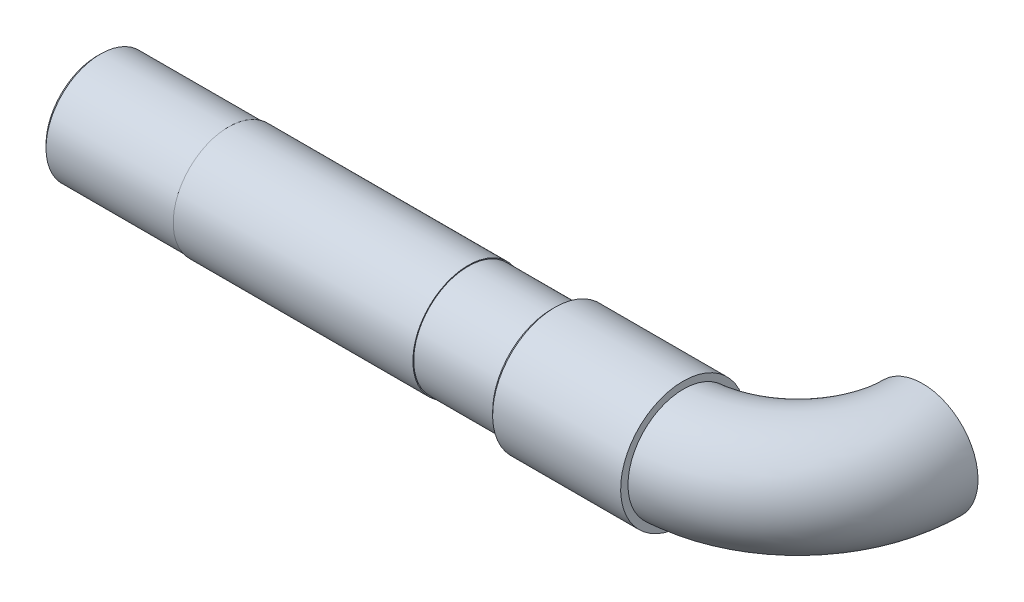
ISO-10303-21;
HEADER;
FILE_DESCRIPTION(('STEP AP214'),'2;1');
FILE_NAME('part.step','',(''),(''),'','','');
FILE_SCHEMA(('AUTOMOTIVE_DESIGN { 1 0 10303 214 1 1 1 1 }'));
ENDSEC;
DATA;
#1=APPLICATION_CONTEXT('core data for automotive mechanical design processes');
#2=APPLICATION_PROTOCOL_DEFINITION('international standard','automotive_design',2000,#1);
#3=PRODUCT_CONTEXT('',#1,'mechanical');
#4=PRODUCT('Part','Part','',(#3));
#5=PRODUCT_RELATED_PRODUCT_CATEGORY('part','',(#4));
#6=PRODUCT_DEFINITION_FORMATION('','',#4);
#7=PRODUCT_DEFINITION_CONTEXT('part definition',#1,'design');
#8=PRODUCT_DEFINITION('design','',#6,#7);
#9=PRODUCT_DEFINITION_SHAPE('','',#8);
#10=(LENGTH_UNIT() NAMED_UNIT(*) SI_UNIT(.MILLI.,.METRE.));
#11=(NAMED_UNIT(*) PLANE_ANGLE_UNIT() SI_UNIT($,.RADIAN.));
#12=(NAMED_UNIT(*) SI_UNIT($,.STERADIAN.) SOLID_ANGLE_UNIT());
#13=UNCERTAINTY_MEASURE_WITH_UNIT(LENGTH_MEASURE(1.E-05),#10,'distance_accuracy_value','');
#14=(GEOMETRIC_REPRESENTATION_CONTEXT(3) GLOBAL_UNCERTAINTY_ASSIGNED_CONTEXT((#13)) GLOBAL_UNIT_ASSIGNED_CONTEXT((#10,
#11,#12)) REPRESENTATION_CONTEXT('',''));
#15=CARTESIAN_POINT('',(0.,0.,0.));
#16=DIRECTION('',(0.,0.,1.));
#17=DIRECTION('',(1.,0.,0.));
#18=AXIS2_PLACEMENT_3D('',#15,#16,#17);
#19=CARTESIAN_POINT('',(103.676907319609,-121.470393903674,-104.4547981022));
#20=DIRECTION('',(1.,0.,0.));
#21=DIRECTION('',(0.,1.,0.));
#22=AXIS2_PLACEMENT_3D('',#19,#20,#21);
#23=CYLINDRICAL_SURFACE('',#22,15.1455);
#24=CARTESIAN_POINT('',(144.062774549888,-121.470393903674,-104.4547981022));
#25=DIRECTION('',(1.,0.,0.));
#26=DIRECTION('',(0.,1.,0.));
#27=AXIS2_PLACEMENT_3D('',#24,#25,#26);
#28=CIRCLE('',#27,15.1455);
#29=CARTESIAN_POINT('',(144.062774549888,-106.324893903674,-104.4547981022));
#30=VERTEX_POINT('',#29);
#31=EDGE_CURVE('E344',#30,#30,#28,.F.);
#32=ORIENTED_EDGE('',*,*,#31,.T.);
#33=EDGE_LOOP('',(#32));
#34=FACE_BOUND('',#33,.T.);
#35=CARTESIAN_POINT('',(166.502774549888,-121.470393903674,-104.4547981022));
#36=DIRECTION('',(1.,0.,0.));
#37=DIRECTION('',(0.,1.,0.));
#38=AXIS2_PLACEMENT_3D('',#35,#36,#37);
#39=CIRCLE('',#38,15.1455);
#40=CARTESIAN_POINT('',(166.502774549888,-106.324893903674,-104.4547981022));
#41=VERTEX_POINT('',#40);
#42=EDGE_CURVE('E18',#41,#41,#39,.F.);
#43=ORIENTED_EDGE('',*,*,#42,.F.);
#44=EDGE_LOOP('',(#43));
#45=FACE_BOUND('',#44,.T.);
#46=ADVANCED_FACE('F15',(#34,#45),#23,.F.);
#47=CARTESIAN_POINT('',(166.502774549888,-121.470393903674,-104.4547981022));
#48=DIRECTION('',(-1.,0.,0.));
#49=DIRECTION('',(0.,-1.,0.));
#50=AXIS2_PLACEMENT_3D('',#47,#48,#49);
#51=PLANE('',#50);
#52=CARTESIAN_POINT('',(166.502774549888,-121.470393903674,-118.7047981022));
#53=CARTESIAN_POINT('',(166.502774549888,-121.070035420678,-118.704800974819));
#54=CARTESIAN_POINT('',(166.502774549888,-120.669724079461,-118.687918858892));
#55=CARTESIAN_POINT('',(166.502774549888,-119.871813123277,-118.62050824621));
#56=CARTESIAN_POINT('',(166.502774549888,-119.474214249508,-118.569970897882));
#57=CARTESIAN_POINT('',(166.502774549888,-118.684265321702,-118.435524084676));
#58=CARTESIAN_POINT('',(166.502774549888,-118.291921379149,-118.351578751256));
#59=CARTESIAN_POINT('',(166.502774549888,-117.515705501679,-118.150915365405));
#60=CARTESIAN_POINT('',(166.502774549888,-117.131833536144,-118.03419743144));
#61=CARTESIAN_POINT('',(166.502774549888,-116.375478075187,-117.768883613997));
#62=CARTESIAN_POINT('',(166.502774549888,-116.002989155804,-117.620303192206));
#63=CARTESIAN_POINT('',(166.502774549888,-115.271847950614,-117.292285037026));
#64=CARTESIAN_POINT('',(166.502774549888,-114.9131958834,-117.112846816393));
#65=CARTESIAN_POINT('',(166.502774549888,-114.212374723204,-116.724440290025));
#66=CARTESIAN_POINT('',(166.502774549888,-113.87020145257,-116.515479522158));
#67=CARTESIAN_POINT('',(166.502774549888,-113.2046733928,-116.069479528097));
#68=CARTESIAN_POINT('',(166.502774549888,-112.881318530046,-115.832440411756));
#69=CARTESIAN_POINT('',(166.502774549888,-112.255690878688,-115.331941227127));
#70=CARTESIAN_POINT('',(166.502774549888,-111.953420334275,-115.068478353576));
#71=CARTESIAN_POINT('',(166.502774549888,-111.372147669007,-114.517025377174));
#72=CARTESIAN_POINT('',(166.502774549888,-111.093145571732,-114.229035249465));
#73=CARTESIAN_POINT('',(166.502774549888,-110.560383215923,-113.630563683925));
#74=CARTESIAN_POINT('',(166.502774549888,-110.306623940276,-113.32008137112));
#75=CARTESIAN_POINT('',(166.502774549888,-109.826163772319,-112.678842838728));
#76=CARTESIAN_POINT('',(166.502774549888,-109.599462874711,-112.348086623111));
#77=CARTESIAN_POINT('',(166.502774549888,-109.17473511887,-111.668658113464));
#78=CARTESIAN_POINT('',(166.502774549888,-108.976707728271,-111.319986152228));
#79=CARTESIAN_POINT('',(166.502774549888,-108.610729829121,-110.607199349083));
#80=CARTESIAN_POINT('',(166.502774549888,-108.442779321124,-110.243084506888));
#81=CARTESIAN_POINT('',(166.502774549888,-108.138149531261,-109.502001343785));
#82=CARTESIAN_POINT('',(166.502774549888,-108.001470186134,-109.125033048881));
#83=CARTESIAN_POINT('',(166.502774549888,-107.760353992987,-108.360922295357));
#84=CARTESIAN_POINT('',(166.502774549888,-107.65591714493,-107.973779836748));
#85=CARTESIAN_POINT('',(166.502774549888,-107.480028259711,-107.192072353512));
#86=CARTESIAN_POINT('',(166.502774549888,-107.408576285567,-106.797507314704));
#87=CARTESIAN_POINT('',(166.502774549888,-107.299165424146,-106.003760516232));
#88=CARTESIAN_POINT('',(166.502774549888,-107.26120653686,-105.604578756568));
#89=CARTESIAN_POINT('',(166.502774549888,-107.219051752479,-104.804437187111));
#90=CARTESIAN_POINT('',(166.502774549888,-107.214855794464,-104.403477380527));
#91=CARTESIAN_POINT('',(166.502774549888,-107.240256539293,-103.602629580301));
#92=CARTESIAN_POINT('',(166.502774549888,-107.269853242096,-103.202741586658));
#93=CARTESIAN_POINT('',(166.502774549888,-107.362628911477,-102.406880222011));
#94=CARTESIAN_POINT('',(166.502774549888,-107.425807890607,-102.010906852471));
#95=CARTESIAN_POINT('',(166.502774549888,-107.585298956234,-101.225690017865));
#96=CARTESIAN_POINT('',(166.502774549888,-107.681611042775,-100.836446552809));
#97=CARTESIAN_POINT('',(166.502774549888,-107.906683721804,-100.067456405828));
#98=CARTESIAN_POINT('',(166.502774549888,-108.035444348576,-99.6877097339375));
#99=CARTESIAN_POINT('',(166.502774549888,-108.324498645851,-98.9404133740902));
#100=CARTESIAN_POINT('',(166.502774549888,-108.484792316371,-98.5728636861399));
#101=CARTESIAN_POINT('',(166.502774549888,-108.835773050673,-97.8525744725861));
#102=CARTESIAN_POINT('',(166.502774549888,-109.026460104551,-97.4998349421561));
#103=CARTESIAN_POINT('',(166.502774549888,-109.436871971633,-96.8116736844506));
#104=CARTESIAN_POINT('',(166.502774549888,-109.656596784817,-96.4762519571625));
#105=CARTESIAN_POINT('',(166.502774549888,-110.123521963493,-95.8251110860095));
#106=CARTESIAN_POINT('',(166.502774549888,-110.370722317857,-95.5093919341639));
#107=CARTESIAN_POINT('',(166.502774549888,-110.890841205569,-94.8999006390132));
#108=CARTESIAN_POINT('',(166.502774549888,-111.163759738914,-94.6061284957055));
#109=CARTESIAN_POINT('',(166.502774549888,-111.733374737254,-94.0426197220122));
#110=CARTESIAN_POINT('',(166.502774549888,-112.030071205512,-93.7728830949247));
#111=CARTESIAN_POINT('',(166.502774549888,-112.645132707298,-93.2593630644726));
#112=CARTESIAN_POINT('',(166.502774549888,-112.963497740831,-93.0155796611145));
#113=CARTESIAN_POINT('',(166.502774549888,-113.619633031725,-92.5556992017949));
#114=CARTESIAN_POINT('',(166.502774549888,-113.957403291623,-92.339602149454));
#115=CARTESIAN_POINT('',(166.502774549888,-114.649947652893,-91.9366307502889));
#116=CARTESIAN_POINT('',(166.502774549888,-115.004721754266,-91.7497564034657));
#117=CARTESIAN_POINT('',(166.502774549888,-115.728751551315,-91.4065589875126));
#118=CARTESIAN_POINT('',(166.502774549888,-116.098007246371,-91.2502359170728));
#119=CARTESIAN_POINT('',(166.502774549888,-116.848375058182,-90.9692524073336));
#120=CARTESIAN_POINT('',(166.502774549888,-117.229487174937,-90.8445919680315));
#121=CARTESIAN_POINT('',(166.502774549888,-118.000858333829,-90.6278199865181));
#122=CARTESIAN_POINT('',(166.502774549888,-118.391117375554,-90.5357084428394));
#123=CARTESIAN_POINT('',(166.502774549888,-119.178007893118,-90.3846891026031));
#124=CARTESIAN_POINT('',(166.502774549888,-119.574639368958,-90.3257813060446));
#125=CARTESIAN_POINT('',(166.502774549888,-120.371454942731,-90.2415882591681));
#126=CARTESIAN_POINT('',(166.502774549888,-120.771639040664,-90.2163030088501));
#127=CARTESIAN_POINT('',(166.502774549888,-121.572714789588,-90.1995348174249));
#128=CARTESIAN_POINT('',(166.502774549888,-121.97360644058,-90.2080518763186));
#129=CARTESIAN_POINT('',(166.502774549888,-122.773247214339,-90.2588277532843));
#130=CARTESIAN_POINT('',(166.502774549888,-123.17199633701,-90.3010865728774));
#131=CARTESIAN_POINT('',(166.502774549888,-123.964517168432,-90.419045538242));
#132=CARTESIAN_POINT('',(166.502774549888,-124.358288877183,-90.494745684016));
#133=CARTESIAN_POINT('',(166.502774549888,-125.138055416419,-90.6790491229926));
#134=CARTESIAN_POINT('',(166.502774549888,-125.524050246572,-90.7876524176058));
#135=CARTESIAN_POINT('',(166.502774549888,-126.285518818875,-91.036990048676));
#136=CARTESIAN_POINT('',(166.502774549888,-126.660992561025,-91.1777243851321));
#137=CARTESIAN_POINT('',(166.502774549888,-127.398749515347,-91.4903235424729));
#138=CARTESIAN_POINT('',(166.502774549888,-127.761032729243,-91.6621883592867));
#139=CARTESIAN_POINT('',(166.502774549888,-128.469833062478,-92.0358266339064));
#140=CARTESIAN_POINT('',(166.502774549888,-128.816350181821,-92.2376000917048));
#141=CARTESIAN_POINT('',(166.502774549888,-129.491154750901,-92.6696211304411));
#142=CARTESIAN_POINT('',(166.502774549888,-129.819442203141,-92.8998687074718));
#143=CARTESIAN_POINT('',(166.502774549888,-130.455453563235,-93.3872010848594));
#144=CARTESIAN_POINT('',(166.502774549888,-130.763177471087,-93.6442858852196));
#145=CARTESIAN_POINT('',(166.502774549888,-131.355874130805,-94.1834651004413));
#146=CARTESIAN_POINT('',(166.502774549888,-131.640846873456,-94.4655595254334));
#147=CARTESIAN_POINT('',(166.502774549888,-132.186015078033,-95.0527523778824));
#148=CARTESIAN_POINT('',(166.502774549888,-132.446210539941,-95.357850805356));
#149=CARTESIAN_POINT('',(166.502774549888,-132.939974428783,-95.9888826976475));
#150=CARTESIAN_POINT('',(166.502774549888,-133.173542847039,-96.3148161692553));
#151=CARTESIAN_POINT('',(166.502774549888,-133.612392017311,-96.9852008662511));
#152=CARTESIAN_POINT('',(166.502774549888,-133.817672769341,-97.3296520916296));
#153=CARTESIAN_POINT('',(166.502774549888,-134.198486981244,-98.0346230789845));
#154=CARTESIAN_POINT('',(166.502774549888,-134.374020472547,-98.395142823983));
#155=CARTESIAN_POINT('',(166.502774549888,-134.694092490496,-99.1296881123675));
#156=CARTESIAN_POINT('',(166.502774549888,-134.838631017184,-99.5037136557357));
#157=CARTESIAN_POINT('',(166.502774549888,-135.095685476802,-100.262611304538));
#158=CARTESIAN_POINT('',(166.502774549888,-135.2082014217,-100.647483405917));
#159=CARTESIAN_POINT('',(166.502774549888,-135.400410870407,-101.425338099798));
#160=CARTESIAN_POINT('',(166.502774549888,-135.480104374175,-101.818320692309));
#161=CARTESIAN_POINT('',(166.502774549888,-135.606102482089,-102.609603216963));
#162=CARTESIAN_POINT('',(166.502774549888,-135.65240702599,-103.007903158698));
#163=CARTESIAN_POINT('',(166.502774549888,-135.711297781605,-103.8069880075));
#164=CARTESIAN_POINT('',(166.502774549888,-135.72388399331,-104.207772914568));
#165=CARTESIAN_POINT('',(166.502774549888,-135.715248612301,-105.008977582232));
#166=CARTESIAN_POINT('',(166.502774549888,-135.694027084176,-105.409397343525));
#167=CARTESIAN_POINT('',(166.502774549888,-135.617927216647,-106.207025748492));
#168=CARTESIAN_POINT('',(166.502774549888,-135.563048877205,-106.604234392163));
#169=CARTESIAN_POINT('',(166.502774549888,-135.420025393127,-107.392617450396));
#170=CARTESIAN_POINT('',(166.502774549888,-135.331880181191,-107.783791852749));
#171=CARTESIAN_POINT('',(166.502774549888,-135.122949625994,-108.557324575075));
#172=CARTESIAN_POINT('',(166.502774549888,-135.002164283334,-108.939682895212));
#173=CARTESIAN_POINT('',(166.502774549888,-134.728809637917,-109.692872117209));
#174=CARTESIAN_POINT('',(166.502774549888,-134.576239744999,-110.063702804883));
#175=CARTESIAN_POINT('',(166.502774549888,-134.240402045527,-110.7911929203));
#176=CARTESIAN_POINT('',(166.502774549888,-134.057134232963,-111.147852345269));
#177=CARTESIAN_POINT('',(166.502774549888,-133.661211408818,-111.844450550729));
#178=CARTESIAN_POINT('',(166.502774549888,-133.448557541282,-112.184389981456));
#179=CARTESIAN_POINT('',(166.502774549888,-132.995369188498,-112.845146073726));
#180=CARTESIAN_POINT('',(166.502774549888,-132.754834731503,-113.165962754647));
#181=CARTESIAN_POINT('',(166.502774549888,-132.247621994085,-113.786160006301));
#182=CARTESIAN_POINT('',(166.502774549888,-131.98094649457,-114.085542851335));
#183=CARTESIAN_POINT('',(166.502774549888,-131.423324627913,-114.660783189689));
#184=CARTESIAN_POINT('',(166.502774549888,-131.132378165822,-114.936640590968));
#185=CARTESIAN_POINT('',(166.502774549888,-130.528206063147,-115.462935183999));
#186=CARTESIAN_POINT('',(166.502774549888,-130.214974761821,-115.713365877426));
#187=CARTESIAN_POINT('',(166.502774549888,-129.568531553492,-116.186942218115));
#188=CARTESIAN_POINT('',(166.502774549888,-129.235319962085,-116.410088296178));
#189=CARTESIAN_POINT('',(166.502774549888,-128.551114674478,-116.827614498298));
#190=CARTESIAN_POINT('',(166.502774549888,-128.200112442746,-117.021980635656));
#191=CARTESIAN_POINT('',(166.502774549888,-127.482973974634,-117.380434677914));
#192=CARTESIAN_POINT('',(166.502774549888,-127.116837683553,-117.544522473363));
#193=CARTESIAN_POINT('',(166.502774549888,-126.372430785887,-117.841092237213));
#194=CARTESIAN_POINT('',(166.502774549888,-125.994173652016,-117.973608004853));
#195=CARTESIAN_POINT('',(166.502774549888,-125.227970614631,-118.206285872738));
#196=CARTESIAN_POINT('',(166.502774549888,-124.840027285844,-118.30645647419));
#197=CARTESIAN_POINT('',(166.502774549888,-123.95955964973,-118.494614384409));
#198=CARTESIAN_POINT('',(166.502774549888,-123.465034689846,-118.573366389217));
#199=CARTESIAN_POINT('',(166.502774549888,-122.470446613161,-118.67845645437));
#200=CARTESIAN_POINT('',(166.502774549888,-121.970383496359,-118.704794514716));
#201=CARTESIAN_POINT('',(166.502774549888,-121.470393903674,-118.7047981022));
#202=B_SPLINE_CURVE_WITH_KNOTS('',3,(#52,#53,#54,#55,#56,#57,#58,#59,#60,#61,#62,#63,#64,#65,
#66,#67,#68,#69,#70,#71,#72,#73,#74,#75,#76,#77,#78,#79,#80,#81,#82,#83,#84,#85,#86,#87,#88,#89,
#90,#91,#92,#93,#94,#95,#96,#97,#98,#99,#100,#101,#102,#103,#104,#105,#106,#107,#108,#109,#110,
#111,#112,#113,#114,#115,#116,#117,#118,#119,#120,#121,#122,#123,#124,#125,#126,#127,#128,#129,
#130,#131,#132,#133,#134,#135,#136,#137,#138,#139,#140,#141,#142,#143,#144,#145,#146,#147,#148,
#149,#150,#151,#152,#153,#154,#155,#156,#157,#158,#159,#160,#161,#162,#163,#164,#165,#166,#167,
#168,#169,#170,#171,#172,#173,#174,#175,#176,#177,#178,#179,#180,#181,#182,#183,#184,#185,#186,
#187,#188,#189,#190,#191,#192,#193,#194,#195,#196,#197,#198,#199,#200,#201),.UNSPECIFIED.,.T.,
.F.,(4,2,2,2,2,2,2,2,2,2,2,2,2,2,2,2,2,2,2,2,2,2,2,2,2,2,2,2,2,2,2,2,2,2,2,2,2,2,2,2,2,2,2,2,2,
2,2,2,2,2,2,2,2,2,2,2,2,2,2,2,2,2,2,2,2,2,2,2,2,2,2,2,2,2,4),(0.,1.20063870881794,
2.40159331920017,3.60384083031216,4.80608399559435,6.00774507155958,7.209425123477,
8.41079890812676,9.6121679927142,10.8136647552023,12.0151627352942,13.2167074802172,
14.4182519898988,15.6197741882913,16.8212964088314,18.0228161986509,19.2243359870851,
20.4258580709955,21.6273801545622,22.8289000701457,24.0304199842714,25.2319403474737,
26.4334607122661,27.6349823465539,28.8365039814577,30.0380252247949,31.2395464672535,
32.4410672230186,33.642587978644,34.8441088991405,36.0456298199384,37.2471508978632,
38.4486719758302,39.6501930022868,40.8517140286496,42.0532350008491,43.2547559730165,
44.4562769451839,45.6577979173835,46.8593189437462,48.0608399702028,49.2623610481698,
50.4638821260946,51.6654030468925,52.8669239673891,54.0684447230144,55.2699654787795,
56.4714867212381,57.6730079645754,58.8745295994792,60.0760512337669,61.2775715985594,
62.4790919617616,63.6806118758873,64.8821317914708,66.0836538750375,67.2851759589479,
68.4866957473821,69.6882155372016,70.8897377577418,72.0912599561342,73.2928044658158,
74.4943492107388,75.6958471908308,76.8973439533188,78.0987130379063,79.300086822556,
80.5017668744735,81.7034279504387,82.9056711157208,84.1079186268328,85.3088732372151,
86.509511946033,88.008935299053,89.5083586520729),.UNSPECIFIED.);
#203=CARTESIAN_POINT('',(166.502774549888,-121.470393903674,-118.7047981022));
#204=VERTEX_POINT('',#203);
#205=EDGE_CURVE('E348',#204,#204,#202,.T.);
#206=ORIENTED_EDGE('',*,*,#205,.T.);
#207=EDGE_LOOP('',(#206));
#208=FACE_BOUND('',#207,.T.);
#209=ORIENTED_EDGE('',*,*,#42,.T.);
#210=EDGE_LOOP('',(#209));
#211=FACE_BOUND('',#210,.T.);
#212=ADVANCED_FACE('F220',(#208,#211),#51,.T.);
#213=CARTESIAN_POINT('',(144.062774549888,-121.470393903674,-104.4547981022));
#214=DIRECTION('',(-1.,0.,0.));
#215=DIRECTION('',(0.,0.,1.));
#216=AXIS2_PLACEMENT_3D('',#213,#214,#215);
#217=PLANE('',#216);
#218=CARTESIAN_POINT('',(144.062774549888,-121.470393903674,-104.4547981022));
#219=DIRECTION('',(1.,0.,0.));
#220=DIRECTION('',(0.,0.,-1.));
#221=AXIS2_PLACEMENT_3D('',#218,#219,#220);
#222=CIRCLE('',#221,14.);
#223=CARTESIAN_POINT('',(144.062774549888,-121.470393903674,-118.4547981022));
#224=VERTEX_POINT('',#223);
#225=EDGE_CURVE('E350',#224,#224,#222,.F.);
#226=ORIENTED_EDGE('',*,*,#225,.T.);
#227=EDGE_LOOP('',(#226));
#228=FACE_BOUND('',#227,.T.);
#229=ORIENTED_EDGE('',*,*,#31,.F.);
#230=EDGE_LOOP('',(#229));
#231=FACE_BOUND('',#230,.T.);
#232=ADVANCED_FACE('F211',(#228,#231),#217,.F.);
#233=CARTESIAN_POINT('',(166.502774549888,-121.470393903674,-142.4547981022));
#234=DIRECTION('',(0.,1.,0.));
#235=DIRECTION('',(1.,0.,0.));
#236=AXIS2_PLACEMENT_3D('',#233,#234,#235);
#237=TOROIDAL_SURFACE('',#236,38.,14.25);
#238=CARTESIAN_POINT('',(190.252774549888,-121.470393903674,-142.4547981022));
#239=CARTESIAN_POINT('',(190.252771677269,-121.070035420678,-142.4547981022));
#240=CARTESIAN_POINT('',(190.269653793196,-120.669724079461,-142.4547981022));
#241=CARTESIAN_POINT('',(190.337064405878,-119.871813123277,-142.4547981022));
#242=CARTESIAN_POINT('',(190.387601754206,-119.474214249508,-142.4547981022));
#243=CARTESIAN_POINT('',(190.522048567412,-118.684265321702,-142.4547981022));
#244=CARTESIAN_POINT('',(190.605993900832,-118.291921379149,-142.4547981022));
#245=CARTESIAN_POINT('',(190.806657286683,-117.515705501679,-142.4547981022));
#246=CARTESIAN_POINT('',(190.923375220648,-117.131833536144,-142.4547981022));
#247=CARTESIAN_POINT('',(191.188689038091,-116.375478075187,-142.4547981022));
#248=CARTESIAN_POINT('',(191.337269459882,-116.002989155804,-142.4547981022));
#249=CARTESIAN_POINT('',(191.665287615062,-115.271847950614,-142.4547981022));
#250=CARTESIAN_POINT('',(191.844725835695,-114.9131958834,-142.4547981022));
#251=CARTESIAN_POINT('',(192.233132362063,-114.212374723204,-142.4547981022));
#252=CARTESIAN_POINT('',(192.44209312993,-113.87020145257,-142.4547981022));
#253=CARTESIAN_POINT('',(192.888093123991,-113.2046733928,-142.4547981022));
#254=CARTESIAN_POINT('',(193.125132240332,-112.881318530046,-142.4547981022));
#255=CARTESIAN_POINT('',(193.625631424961,-112.255690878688,-142.4547981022));
#256=CARTESIAN_POINT('',(193.889094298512,-111.953420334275,-142.4547981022));
#257=CARTESIAN_POINT('',(194.440547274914,-111.372147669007,-142.4547981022));
#258=CARTESIAN_POINT('',(194.728537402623,-111.093145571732,-142.4547981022));
#259=CARTESIAN_POINT('',(195.327008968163,-110.560383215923,-142.4547981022));
#260=CARTESIAN_POINT('',(195.637491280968,-110.306623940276,-142.4547981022));
#261=CARTESIAN_POINT('',(196.27872981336,-109.826163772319,-142.4547981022));
#262=CARTESIAN_POINT('',(196.609486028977,-109.599462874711,-142.4547981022));
#263=CARTESIAN_POINT('',(197.288914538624,-109.17473511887,-142.4547981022));
#264=CARTESIAN_POINT('',(197.63758649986,-108.976707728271,-142.4547981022));
#265=CARTESIAN_POINT('',(198.350373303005,-108.610729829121,-142.4547981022));
#266=CARTESIAN_POINT('',(198.7144881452,-108.442779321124,-142.4547981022));
#267=CARTESIAN_POINT('',(199.455571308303,-108.138149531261,-142.4547981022));
#268=CARTESIAN_POINT('',(199.832539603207,-108.001470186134,-142.4547981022));
#269=CARTESIAN_POINT('',(200.596650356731,-107.760353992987,-142.4547981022));
#270=CARTESIAN_POINT('',(200.983792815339,-107.65591714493,-142.4547981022));
#271=CARTESIAN_POINT('',(201.765500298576,-107.480028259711,-142.4547981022));
#272=CARTESIAN_POINT('',(202.160065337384,-107.408576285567,-142.4547981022));
#273=CARTESIAN_POINT('',(202.953812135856,-107.299165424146,-142.4547981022));
#274=CARTESIAN_POINT('',(203.35299389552,-107.26120653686,-142.4547981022));
#275=CARTESIAN_POINT('',(204.153135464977,-107.219051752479,-142.4547981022));
#276=CARTESIAN_POINT('',(204.554095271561,-107.214855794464,-142.4547981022));
#277=CARTESIAN_POINT('',(205.354943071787,-107.240256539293,-142.4547981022));
#278=CARTESIAN_POINT('',(205.75483106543,-107.269853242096,-142.4547981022));
#279=CARTESIAN_POINT('',(206.550692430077,-107.362628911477,-142.4547981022));
#280=CARTESIAN_POINT('',(206.946665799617,-107.425807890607,-142.4547981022));
#281=CARTESIAN_POINT('',(207.731882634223,-107.585298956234,-142.4547981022));
#282=CARTESIAN_POINT('',(208.121126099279,-107.681611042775,-142.4547981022));
#283=CARTESIAN_POINT('',(208.89011624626,-107.906683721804,-142.4547981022));
#284=CARTESIAN_POINT('',(209.269862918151,-108.035444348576,-142.4547981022));
#285=CARTESIAN_POINT('',(210.017159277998,-108.324498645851,-142.4547981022));
#286=CARTESIAN_POINT('',(210.384708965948,-108.484792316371,-142.4547981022));
#287=CARTESIAN_POINT('',(211.104998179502,-108.835773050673,-142.4547981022));
#288=CARTESIAN_POINT('',(211.457737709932,-109.026460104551,-142.4547981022));
#289=CARTESIAN_POINT('',(212.145898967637,-109.436871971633,-142.4547981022));
#290=CARTESIAN_POINT('',(212.481320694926,-109.656596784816,-142.4547981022));
#291=CARTESIAN_POINT('',(213.132461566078,-110.123521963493,-142.4547981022));
#292=CARTESIAN_POINT('',(213.448180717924,-110.370722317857,-142.4547981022));
#293=CARTESIAN_POINT('',(214.057672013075,-110.890841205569,-142.4547981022));
#294=CARTESIAN_POINT('',(214.351444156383,-111.163759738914,-142.4547981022));
#295=CARTESIAN_POINT('',(214.914952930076,-111.733374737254,-142.4547981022));
#296=CARTESIAN_POINT('',(215.184689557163,-112.030071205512,-142.4547981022));
#297=CARTESIAN_POINT('',(215.698209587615,-112.645132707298,-142.4547981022));
#298=CARTESIAN_POINT('',(215.941992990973,-112.963497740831,-142.4547981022));
#299=CARTESIAN_POINT('',(216.401873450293,-113.619633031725,-142.4547981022));
#300=CARTESIAN_POINT('',(216.617970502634,-113.957403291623,-142.4547981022));
#301=CARTESIAN_POINT('',(217.020941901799,-114.649947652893,-142.4547981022));
#302=CARTESIAN_POINT('',(217.207816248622,-115.004721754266,-142.4547981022));
#303=CARTESIAN_POINT('',(217.551013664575,-115.728751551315,-142.4547981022));
#304=CARTESIAN_POINT('',(217.707336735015,-116.098007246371,-142.4547981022));
#305=CARTESIAN_POINT('',(217.988320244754,-116.848375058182,-142.4547981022));
#306=CARTESIAN_POINT('',(218.112980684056,-117.229487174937,-142.4547981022));
#307=CARTESIAN_POINT('',(218.32975266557,-118.000858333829,-142.4547981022));
#308=CARTESIAN_POINT('',(218.421864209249,-118.391117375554,-142.4547981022));
#309=CARTESIAN_POINT('',(218.572883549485,-119.178007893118,-142.4547981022));
#310=CARTESIAN_POINT('',(218.631791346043,-119.574639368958,-142.4547981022));
#311=CARTESIAN_POINT('',(218.71598439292,-120.371454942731,-142.4547981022));
#312=CARTESIAN_POINT('',(218.741269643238,-120.771639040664,-142.4547981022));
#313=CARTESIAN_POINT('',(218.758037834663,-121.572714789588,-142.4547981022));
#314=CARTESIAN_POINT('',(218.749520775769,-121.97360644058,-142.4547981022));
#315=CARTESIAN_POINT('',(218.698744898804,-122.773247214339,-142.4547981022));
#316=CARTESIAN_POINT('',(218.656486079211,-123.17199633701,-142.4547981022));
#317=CARTESIAN_POINT('',(218.538527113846,-123.964517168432,-142.4547981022));
#318=CARTESIAN_POINT('',(218.462826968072,-124.358288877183,-142.4547981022));
#319=CARTESIAN_POINT('',(218.278523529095,-125.138055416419,-142.4547981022));
#320=CARTESIAN_POINT('',(218.169920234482,-125.524050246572,-142.4547981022));
#321=CARTESIAN_POINT('',(217.920582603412,-126.285518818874,-142.4547981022));
#322=CARTESIAN_POINT('',(217.779848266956,-126.660992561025,-142.4547981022));
#323=CARTESIAN_POINT('',(217.467249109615,-127.398749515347,-142.4547981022));
#324=CARTESIAN_POINT('',(217.295384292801,-127.761032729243,-142.4547981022));
#325=CARTESIAN_POINT('',(216.921746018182,-128.469833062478,-142.4547981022));
#326=CARTESIAN_POINT('',(216.719972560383,-128.816350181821,-142.4547981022));
#327=CARTESIAN_POINT('',(216.287951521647,-129.491154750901,-142.4547981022));
#328=CARTESIAN_POINT('',(216.057703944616,-129.819442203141,-142.4547981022));
#329=CARTESIAN_POINT('',(215.570371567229,-130.455453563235,-142.4547981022));
#330=CARTESIAN_POINT('',(215.313286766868,-130.763177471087,-142.4547981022));
#331=CARTESIAN_POINT('',(214.774107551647,-131.355874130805,-142.4547981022));
#332=CARTESIAN_POINT('',(214.492013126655,-131.640846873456,-142.4547981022));
#333=CARTESIAN_POINT('',(213.904820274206,-132.186015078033,-142.4547981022));
#334=CARTESIAN_POINT('',(213.599721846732,-132.446210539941,-142.4547981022));
#335=CARTESIAN_POINT('',(212.968689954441,-132.939974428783,-142.4547981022));
#336=CARTESIAN_POINT('',(212.642756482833,-133.173542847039,-142.4547981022));
#337=CARTESIAN_POINT('',(211.972371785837,-133.612392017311,-142.4547981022));
#338=CARTESIAN_POINT('',(211.627920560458,-133.817672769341,-142.4547981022));
#339=CARTESIAN_POINT('',(210.922949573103,-134.198486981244,-142.4547981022));
#340=CARTESIAN_POINT('',(210.562429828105,-134.374020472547,-142.4547981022));
#341=CARTESIAN_POINT('',(209.82788453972,-134.694092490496,-142.4547981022));
#342=CARTESIAN_POINT('',(209.453858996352,-134.838631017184,-142.4547981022));
#343=CARTESIAN_POINT('',(208.69496134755,-135.095685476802,-142.4547981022));
#344=CARTESIAN_POINT('',(208.310089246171,-135.2082014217,-142.4547981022));
#345=CARTESIAN_POINT('',(207.53223455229,-135.400410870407,-142.4547981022));
#346=CARTESIAN_POINT('',(207.139251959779,-135.480104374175,-142.4547981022));
#347=CARTESIAN_POINT('',(206.347969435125,-135.606102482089,-142.4547981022));
#348=CARTESIAN_POINT('',(205.94966949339,-135.65240702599,-142.4547981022));
#349=CARTESIAN_POINT('',(205.150584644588,-135.711297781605,-142.4547981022));
#350=CARTESIAN_POINT('',(204.74979973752,-135.72388399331,-142.4547981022));
#351=CARTESIAN_POINT('',(203.948595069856,-135.715248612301,-142.4547981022));
#352=CARTESIAN_POINT('',(203.548175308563,-135.694027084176,-142.4547981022));
#353=CARTESIAN_POINT('',(202.750546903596,-135.617927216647,-142.4547981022));
#354=CARTESIAN_POINT('',(202.353338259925,-135.563048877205,-142.4547981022));
#355=CARTESIAN_POINT('',(201.564955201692,-135.420025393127,-142.4547981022));
#356=CARTESIAN_POINT('',(201.173780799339,-135.331880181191,-142.4547981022));
#357=CARTESIAN_POINT('',(200.400248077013,-135.122949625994,-142.4547981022));
#358=CARTESIAN_POINT('',(200.017889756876,-135.002164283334,-142.4547981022));
#359=CARTESIAN_POINT('',(199.264700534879,-134.728809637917,-142.4547981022));
#360=CARTESIAN_POINT('',(198.893869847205,-134.576239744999,-142.4547981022));
#361=CARTESIAN_POINT('',(198.166379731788,-134.240402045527,-142.4547981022));
#362=CARTESIAN_POINT('',(197.809720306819,-134.057134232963,-142.4547981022));
#363=CARTESIAN_POINT('',(197.113122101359,-133.661211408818,-142.4547981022));
#364=CARTESIAN_POINT('',(196.773182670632,-133.448557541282,-142.4547981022));
#365=CARTESIAN_POINT('',(196.112426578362,-132.995369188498,-142.4547981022));
#366=CARTESIAN_POINT('',(195.791609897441,-132.754834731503,-142.4547981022));
#367=CARTESIAN_POINT('',(195.171412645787,-132.247621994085,-142.4547981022));
#368=CARTESIAN_POINT('',(194.872029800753,-131.98094649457,-142.4547981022));
#369=CARTESIAN_POINT('',(194.296789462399,-131.423324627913,-142.4547981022));
#370=CARTESIAN_POINT('',(194.02093206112,-131.132378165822,-142.4547981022));
#371=CARTESIAN_POINT('',(193.494637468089,-130.528206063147,-142.4547981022));
#372=CARTESIAN_POINT('',(193.244206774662,-130.214974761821,-142.4547981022));
#373=CARTESIAN_POINT('',(192.770630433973,-129.568531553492,-142.4547981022));
#374=CARTESIAN_POINT('',(192.54748435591,-129.235319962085,-142.4547981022));
#375=CARTESIAN_POINT('',(192.12995815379,-128.551114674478,-142.4547981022));
#376=CARTESIAN_POINT('',(191.935592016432,-128.200112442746,-142.4547981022));
#377=CARTESIAN_POINT('',(191.577137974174,-127.482973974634,-142.4547981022));
#378=CARTESIAN_POINT('',(191.413050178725,-127.116837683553,-142.4547981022));
#379=CARTESIAN_POINT('',(191.116480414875,-126.372430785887,-142.4547981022));
#380=CARTESIAN_POINT('',(190.983964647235,-125.994173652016,-142.4547981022));
#381=CARTESIAN_POINT('',(190.75128677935,-125.227970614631,-142.4547981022));
#382=CARTESIAN_POINT('',(190.651116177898,-124.840027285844,-142.4547981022));
#383=CARTESIAN_POINT('',(190.462958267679,-123.959559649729,-142.4547981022));
#384=CARTESIAN_POINT('',(190.384206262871,-123.465034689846,-142.4547981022));
#385=CARTESIAN_POINT('',(190.279116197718,-122.470446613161,-142.4547981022));
#386=CARTESIAN_POINT('',(190.252778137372,-121.970383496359,-142.4547981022));
#387=CARTESIAN_POINT('',(190.252774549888,-121.470393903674,-142.4547981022));
#388=B_SPLINE_CURVE_WITH_KNOTS('',3,(#238,#239,#240,#241,#242,#243,#244,#245,#246,#247,#248,
#249,#250,#251,#252,#253,#254,#255,#256,#257,#258,#259,#260,#261,#262,#263,#264,#265,#266,#267,
#268,#269,#270,#271,#272,#273,#274,#275,#276,#277,#278,#279,#280,#281,#282,#283,#284,#285,#286,
#287,#288,#289,#290,#291,#292,#293,#294,#295,#296,#297,#298,#299,#300,#301,#302,#303,#304,#305,
#306,#307,#308,#309,#310,#311,#312,#313,#314,#315,#316,#317,#318,#319,#320,#321,#322,#323,#324,
#325,#326,#327,#328,#329,#330,#331,#332,#333,#334,#335,#336,#337,#338,#339,#340,#341,#342,#343,
#344,#345,#346,#347,#348,#349,#350,#351,#352,#353,#354,#355,#356,#357,#358,#359,#360,#361,#362,
#363,#364,#365,#366,#367,#368,#369,#370,#371,#372,#373,#374,#375,#376,#377,#378,#379,#380,#381,
#382,#383,#384,#385,#386,#387),.UNSPECIFIED.,.T.,.F.,(4,2,2,2,2,2,2,2,2,2,2,2,2,2,2,2,2,2,2,2,2,
2,2,2,2,2,2,2,2,2,2,2,2,2,2,2,2,2,2,2,2,2,2,2,2,2,2,2,2,2,2,2,2,2,2,2,2,2,2,2,2,2,2,2,2,2,2,2,2,
2,2,2,2,2,4),(0.,1.20063870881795,2.40159331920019,3.60384083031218,4.80608399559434,
6.00774507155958,7.20942512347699,8.41079890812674,9.61216799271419,10.8136647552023,
12.0151627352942,13.2167074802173,14.4182519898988,15.6197741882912,16.8212964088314,
18.0228161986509,19.2243359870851,20.4258580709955,21.6273801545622,22.8289000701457,
24.0304199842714,25.2319403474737,26.4334607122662,27.6349823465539,28.8365039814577,
30.0380252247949,31.2395464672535,32.4410672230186,33.6425879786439,34.8441088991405,
36.0456298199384,37.2471508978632,38.4486719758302,39.6501930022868,40.8517140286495,
42.0532350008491,43.2547559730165,44.4562769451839,45.6577979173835,46.8593189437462,
48.0608399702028,49.2623610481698,50.4638821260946,51.6654030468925,52.8669239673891,
54.0684447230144,55.2699654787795,56.4714867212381,57.6730079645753,58.8745295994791,
60.0760512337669,61.2775715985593,62.4790919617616,63.6806118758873,64.8821317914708,
66.0836538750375,67.2851759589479,68.4866957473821,69.6882155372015,70.8897377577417,
72.0912599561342,73.2928044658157,74.4943492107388,75.6958471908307,76.8973439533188,
78.0987130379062,79.300086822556,80.5017668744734,81.7034279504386,82.9056711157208,
84.1079186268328,85.3088732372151,86.509511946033,88.008935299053,89.5083586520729),.UNSPECIFIED.);
#389=CARTESIAN_POINT('',(190.252774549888,-121.470393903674,-142.4547981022));
#390=VERTEX_POINT('',#389);
#391=EDGE_CURVE('E360',#390,#390,#388,.T.);
#392=ORIENTED_EDGE('',*,*,#391,.T.);
#393=EDGE_LOOP('',(#392));
#394=FACE_BOUND('',#393,.T.);
#395=ORIENTED_EDGE('',*,*,#205,.F.);
#396=EDGE_LOOP('',(#395));
#397=FACE_BOUND('',#396,.T.);
#398=ADVANCED_FACE('F202',(#394,#397),#237,.F.);
#399=CARTESIAN_POINT('',(104.062774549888,-121.470393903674,-104.4547981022));
#400=DIRECTION('',(1.,0.,0.));
#401=DIRECTION('',(0.,0.,-1.));
#402=AXIS2_PLACEMENT_3D('',#399,#400,#401);
#403=CYLINDRICAL_SURFACE('',#402,14.);
#404=ORIENTED_EDGE('',*,*,#225,.F.);
#405=EDGE_LOOP('',(#404));
#406=FACE_BOUND('',#405,.T.);
#407=CARTESIAN_POINT('',(104.062774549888,-121.470393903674,-104.4547981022));
#408=DIRECTION('',(1.,0.,0.));
#409=DIRECTION('',(0.,0.,-1.));
#410=AXIS2_PLACEMENT_3D('',#407,#408,#409);
#411=CIRCLE('',#410,14.);
#412=CARTESIAN_POINT('',(104.062774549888,-121.470393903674,-118.4547981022));
#413=VERTEX_POINT('',#412);
#414=EDGE_CURVE('E366',#413,#413,#411,.T.);
#415=ORIENTED_EDGE('',*,*,#414,.F.);
#416=EDGE_LOOP('',(#415));
#417=FACE_BOUND('',#416,.T.);
#418=ADVANCED_FACE('F193',(#406,#417),#403,.F.);
#419=CARTESIAN_POINT('',(204.502774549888,-121.470393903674,-142.4547981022));
#420=DIRECTION('',(0.,0.,1.));
#421=DIRECTION('',(1.,0.,0.));
#422=AXIS2_PLACEMENT_3D('',#419,#420,#421);
#423=PLANE('',#422);
#424=ORIENTED_EDGE('',*,*,#391,.F.);
#425=EDGE_LOOP('',(#424));
#426=FACE_BOUND('',#425,.T.);
#427=CARTESIAN_POINT('',(187.652774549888,-121.470393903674,-142.4547981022));
#428=CARTESIAN_POINT('',(187.652771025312,-121.943799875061,-142.4547981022));
#429=CARTESIAN_POINT('',(187.672733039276,-122.417149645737,-142.4547981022));
#430=CARTESIAN_POINT('',(187.752444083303,-123.360646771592,-142.4547981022));
#431=CARTESIAN_POINT('',(187.812203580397,-123.83079325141,-142.4547981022));
#432=CARTESIAN_POINT('',(187.97117748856,-124.764864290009,-142.4547981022));
#433=CARTESIAN_POINT('',(188.070434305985,-125.22878160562,-142.4547981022));
#434=CARTESIAN_POINT('',(188.30772322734,-126.146656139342,-142.4547981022));
#435=CARTESIAN_POINT('',(188.445755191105,-126.600613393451,-142.4547981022));
#436=CARTESIAN_POINT('',(188.681055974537,-127.271420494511,-142.4547981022));
#437=CARTESIAN_POINT('',(188.764191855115,-127.493320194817,-142.4547981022));
#438=CARTESIAN_POINT('',(188.939720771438,-127.933361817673,-142.4547981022));
#439=CARTESIAN_POINT('',(189.032111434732,-128.151504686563,-142.4547981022));
#440=CARTESIAN_POINT('',(189.322984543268,-128.799840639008,-142.4547981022));
#441=CARTESIAN_POINT('',(189.535180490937,-129.223976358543,-142.4547981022));
#442=CARTESIAN_POINT('',(189.994467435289,-130.052699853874,-142.4547981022));
#443=CARTESIAN_POINT('',(190.24154952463,-130.457292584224,-142.4547981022));
#444=CARTESIAN_POINT('',(190.768921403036,-131.244241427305,-142.4547981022));
#445=CARTESIAN_POINT('',(191.049211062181,-131.626597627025,-142.4547981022));
#446=CARTESIAN_POINT('',(191.641030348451,-132.366377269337,-142.4547981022));
#447=CARTESIAN_POINT('',(191.9525632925,-132.723798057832,-142.4547981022));
#448=CARTESIAN_POINT('',(192.604631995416,-133.411126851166,-142.4547981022));
#449=CARTESIAN_POINT('',(192.945167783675,-133.741034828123,-142.4547981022));
#450=CARTESIAN_POINT('',(193.652834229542,-134.371003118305,-142.4547981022));
#451=CARTESIAN_POINT('',(194.019965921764,-134.671062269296,-142.4547981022));
#452=CARTESIAN_POINT('',(194.7782023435,-135.239185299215,-142.4547981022));
#453=CARTESIAN_POINT('',(195.169307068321,-135.507249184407,-142.4547981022));
#454=CARTESIAN_POINT('',(195.972701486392,-136.009471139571,-142.4547981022));
#455=CARTESIAN_POINT('',(196.384990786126,-136.243629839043,-142.4547981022));
#456=CARTESIAN_POINT('',(197.227829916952,-136.676382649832,-142.4547981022));
#457=CARTESIAN_POINT('',(197.658379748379,-136.874976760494,-142.4547981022));
#458=CARTESIAN_POINT('',(198.534678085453,-137.235188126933,-142.4547981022));
#459=CARTESIAN_POINT('',(198.980426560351,-137.396805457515,-142.4547981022));
#460=CARTESIAN_POINT('',(199.883954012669,-137.681914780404,-142.4547981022));
#461=CARTESIAN_POINT('',(200.341732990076,-137.805406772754,-142.4547981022));
#462=CARTESIAN_POINT('',(201.266067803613,-138.013387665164,-142.4547981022));
#463=CARTESIAN_POINT('',(201.732623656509,-138.097876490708,-142.4547981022));
#464=CARTESIAN_POINT('',(202.67119443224,-138.227250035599,-142.4547981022));
#465=CARTESIAN_POINT('',(203.143209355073,-138.272134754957,-142.4547981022));
#466=CARTESIAN_POINT('',(204.089341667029,-138.321980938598,-142.4547981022));
#467=CARTESIAN_POINT('',(204.563459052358,-138.326942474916,-142.4547981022));
#468=CARTESIAN_POINT('',(205.510426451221,-138.296907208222,-142.4547981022));
#469=CARTESIAN_POINT('',(205.983276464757,-138.261910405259,-142.4547981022));
#470=CARTESIAN_POINT('',(206.924347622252,-138.152207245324,-142.4547981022));
#471=CARTESIAN_POINT('',(207.39256876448,-138.077500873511,-142.4547981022));
#472=CARTESIAN_POINT('',(208.321053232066,-137.888909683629,-142.4547981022));
#473=CARTESIAN_POINT('',(208.781316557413,-137.775024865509,-142.4547981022));
#474=CARTESIAN_POINT('',(209.69061367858,-137.508886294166,-142.4547981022));
#475=CARTESIAN_POINT('',(210.139647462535,-137.356632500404,-142.4547981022));
#476=CARTESIAN_POINT('',(211.023292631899,-137.014838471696,-142.4547981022));
#477=CARTESIAN_POINT('',(211.457904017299,-136.82529823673,-142.4547981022));
#478=CARTESIAN_POINT('',(212.309614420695,-136.41027891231,-142.4547981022));
#479=CARTESIAN_POINT('',(212.726713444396,-136.184799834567,-142.4547981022));
#480=CARTESIAN_POINT('',(213.540433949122,-135.699505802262,-142.4547981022));
#481=CARTESIAN_POINT('',(213.93705543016,-135.439690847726,-142.4547981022));
#482=CARTESIAN_POINT('',(214.707000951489,-134.887572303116,-142.4547981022));
#483=CARTESIAN_POINT('',(215.080325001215,-134.595268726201,-142.4547981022));
#484=CARTESIAN_POINT('',(215.801021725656,-133.980250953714,-142.4547981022));
#485=CARTESIAN_POINT('',(216.148394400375,-133.657536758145,-142.4547981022));
#486=CARTESIAN_POINT('',(216.81471880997,-132.983992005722,-142.4547981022));
#487=CARTESIAN_POINT('',(217.133670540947,-132.63316144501,-142.4547981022));
#488=CARTESIAN_POINT('',(217.740885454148,-131.905878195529,-142.4547981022));
#489=CARTESIAN_POINT('',(218.029148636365,-131.529425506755,-142.4547981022));
#490=CARTESIAN_POINT('',(218.572937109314,-130.753574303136,-142.4547981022));
#491=CARTESIAN_POINT('',(218.828462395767,-130.354175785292,-142.4547981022));
#492=CARTESIAN_POINT('',(219.304958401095,-129.535272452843,-142.4547981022));
#493=CARTESIAN_POINT('',(219.52592911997,-129.115767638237,-142.4547981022));
#494=CARTESIAN_POINT('',(219.931745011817,-128.259634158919,-142.4547981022));
#495=CARTESIAN_POINT('',(220.116590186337,-127.823005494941,-142.4547981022));
#496=CARTESIAN_POINT('',(220.448840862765,-126.935728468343,-142.4547981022));
#497=CARTESIAN_POINT('',(220.596246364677,-126.485080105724,-142.4547981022));
#498=CARTESIAN_POINT('',(220.852569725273,-125.572967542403,-142.4547981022));
#499=CARTESIAN_POINT('',(220.961487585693,-125.111503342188,-142.4547981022));
#500=CARTESIAN_POINT('',(221.140061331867,-124.18103981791,-142.4547981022));
#501=CARTESIAN_POINT('',(221.209717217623,-123.712040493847,-142.4547981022));
#502=CARTESIAN_POINT('',(221.309271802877,-122.769841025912,-142.4547981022));
#503=CARTESIAN_POINT('',(221.339170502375,-122.296640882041,-142.4547981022));
#504=CARTESIAN_POINT('',(221.358998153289,-121.349403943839,-142.4547981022));
#505=CARTESIAN_POINT('',(221.348927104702,-120.875367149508,-142.4547981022));
#506=CARTESIAN_POINT('',(221.288886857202,-119.929827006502,-142.4547981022));
#507=CARTESIAN_POINT('',(221.23891765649,-119.45832365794,-142.4547981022));
#508=CARTESIAN_POINT('',(221.099436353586,-118.521202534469,-142.4547981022));
#509=CARTESIAN_POINT('',(221.00992425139,-118.05558475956,-142.4547981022));
#510=CARTESIAN_POINT('',(220.791993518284,-117.1335450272,-142.4547981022));
#511=CARTESIAN_POINT('',(220.663574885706,-116.677123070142,-142.4547981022));
#512=CARTESIAN_POINT('',(220.368744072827,-115.776719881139,-142.4547981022));
#513=CARTESIAN_POINT('',(220.202331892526,-115.332738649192,-142.4547981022));
#514=CARTESIAN_POINT('',(219.83269709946,-114.460373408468,-142.4547981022));
#515=CARTESIAN_POINT('',(219.629474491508,-114.03198939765,-142.4547981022));
#516=CARTESIAN_POINT('',(219.187663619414,-113.193864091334,-142.4547981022));
#517=CARTESIAN_POINT('',(218.949075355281,-112.78412279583,-142.4547981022));
#518=CARTESIAN_POINT('',(218.438229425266,-111.986195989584,-142.4547981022));
#519=CARTESIAN_POINT('',(218.165971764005,-111.598010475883,-142.4547981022));
#520=CARTESIAN_POINT('',(217.589722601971,-110.845954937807,-142.4547981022));
#521=CARTESIAN_POINT('',(217.285731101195,-110.482084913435,-142.4547981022));
#522=CARTESIAN_POINT('',(216.648175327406,-109.781247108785,-142.4547981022));
#523=CARTESIAN_POINT('',(216.314611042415,-109.444279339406,-142.4547981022));
#524=CARTESIAN_POINT('',(215.620281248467,-108.79964184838,-142.4547981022));
#525=CARTESIAN_POINT('',(215.259515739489,-108.491972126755,-142.4547981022));
#526=CARTESIAN_POINT('',(214.513348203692,-107.90811798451,-142.4547981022));
#527=CARTESIAN_POINT('',(214.127946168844,-107.631933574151,-142.4547981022));
#528=CARTESIAN_POINT('',(213.335245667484,-107.113013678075,-142.4547981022));
#529=CARTESIAN_POINT('',(212.927947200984,-106.870278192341,-142.4547981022));
#530=CARTESIAN_POINT('',(212.094349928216,-106.419982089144,-142.4547981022));
#531=CARTESIAN_POINT('',(211.668051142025,-106.212421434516,-142.4547981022));
#532=CARTESIAN_POINT('',(210.799483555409,-105.833950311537,-142.4547981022));
#533=CARTESIAN_POINT('',(210.357214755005,-105.663039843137,-142.4547981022));
#534=CARTESIAN_POINT('',(209.459851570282,-105.359084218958,-142.4547981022));
#535=CARTESIAN_POINT('',(209.004757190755,-105.226039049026,-142.4547981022));
#536=CARTESIAN_POINT('',(208.084978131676,-104.998759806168,-142.4547981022));
#537=CARTESIAN_POINT('',(207.620293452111,-104.90452573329,-142.4547981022));
#538=CARTESIAN_POINT('',(206.68463657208,-104.755538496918,-142.4547981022));
#539=CARTESIAN_POINT('',(206.213664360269,-104.700785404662,-142.4547981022));
#540=CARTESIAN_POINT('',(205.268781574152,-104.63114966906,-142.4547981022));
#541=CARTESIAN_POINT('',(204.794870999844,-104.616267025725,-142.4547981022));
#542=CARTESIAN_POINT('',(203.847481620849,-104.62647798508,-142.4547981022));
#543=CARTESIAN_POINT('',(203.374002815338,-104.651571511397,-142.4547981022));
#544=CARTESIAN_POINT('',(202.430842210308,-104.741556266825,-142.4547981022));
#545=CARTESIAN_POINT('',(201.961160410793,-104.806447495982,-142.4547981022));
#546=CARTESIAN_POINT('',(201.028932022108,-104.975566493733,-142.4547981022));
#547=CARTESIAN_POINT('',(200.566385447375,-105.079794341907,-142.4547981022));
#548=CARTESIAN_POINT('',(199.651716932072,-105.326845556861,-142.4547981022));
#549=CARTESIAN_POINT('',(199.19959499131,-105.469668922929,-142.4547981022));
#550=CARTESIAN_POINT('',(198.308981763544,-105.792898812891,-142.4547981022));
#551=CARTESIAN_POINT('',(197.870490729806,-105.973306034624,-142.4547981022));
#552=CARTESIAN_POINT('',(197.010265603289,-106.370419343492,-142.4547981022));
#553=CARTESIAN_POINT('',(196.58853151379,-106.587125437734,-142.4547981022));
#554=CARTESIAN_POINT('',(195.764834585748,-107.055286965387,-142.4547981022));
#555=CARTESIAN_POINT('',(195.362870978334,-107.306741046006,-142.4547981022));
#556=CARTESIAN_POINT('',(194.581556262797,-107.842615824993,-142.4547981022));
#557=CARTESIAN_POINT('',(194.202205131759,-108.127036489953,-142.4547981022));
#558=CARTESIAN_POINT('',(193.468847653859,-108.726795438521,-142.4547981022));
#559=CARTESIAN_POINT('',(193.114838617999,-109.042130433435,-142.4547981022));
#560=CARTESIAN_POINT('',(192.43464748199,-109.701485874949,-142.4547981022));
#561=CARTESIAN_POINT('',(192.108465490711,-110.04550643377,-142.4547981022));
#562=CARTESIAN_POINT('',(191.486125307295,-110.759943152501,-142.4547981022));
#563=CARTESIAN_POINT('',(191.18997479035,-111.130366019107,-142.4547981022));
#564=CARTESIAN_POINT('',(190.770028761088,-111.70359547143,-142.4547981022));
#565=CARTESIAN_POINT('',(190.634088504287,-111.897612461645,-142.4547981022));
#566=CARTESIAN_POINT('',(190.370471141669,-112.29125305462,-142.4547981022));
#567=CARTESIAN_POINT('',(190.242796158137,-112.490878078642,-142.4547981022));
#568=CARTESIAN_POINT('',(189.872499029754,-113.097696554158,-142.4547981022));
#569=CARTESIAN_POINT('',(189.642642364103,-113.51278199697,-142.4547981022));
#570=CARTESIAN_POINT('',(189.218766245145,-114.360796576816,-142.4547981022));
#571=CARTESIAN_POINT('',(189.024746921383,-114.793725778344,-142.4547981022));
#572=CARTESIAN_POINT('',(188.674071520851,-115.673946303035,-142.4547981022));
#573=CARTESIAN_POINT('',(188.517375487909,-116.121221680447,-142.4547981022));
#574=CARTESIAN_POINT('',(188.242242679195,-117.027225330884,-142.4547981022));
#575=CARTESIAN_POINT('',(188.123795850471,-117.485950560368,-142.4547981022));
#576=CARTESIAN_POINT('',(187.901307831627,-118.527064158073,-142.4547981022));
#577=CARTESIAN_POINT('',(187.80818680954,-119.11181843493,-142.4547981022));
#578=CARTESIAN_POINT('',(187.683922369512,-120.287875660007,-142.4547981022));
#579=CARTESIAN_POINT('',(187.652778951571,-120.879178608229,-142.4547981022));
#580=CARTESIAN_POINT('',(187.652774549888,-121.470393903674,-142.4547981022));
#581=B_SPLINE_CURVE_WITH_KNOTS('',3,(#427,#428,#429,#430,#431,#432,#433,#434,#435,#436,#437,
#438,#439,#440,#441,#442,#443,#444,#445,#446,#447,#448,#449,#450,#451,#452,#453,#454,#455,#456,
#457,#458,#459,#460,#461,#462,#463,#464,#465,#466,#467,#468,#469,#470,#471,#472,#473,#474,#475,
#476,#477,#478,#479,#480,#481,#482,#483,#484,#485,#486,#487,#488,#489,#490,#491,#492,#493,#494,
#495,#496,#497,#498,#499,#500,#501,#502,#503,#504,#505,#506,#507,#508,#509,#510,#511,#512,#513,
#514,#515,#516,#517,#518,#519,#520,#521,#522,#523,#524,#525,#526,#527,#528,#529,#530,#531,#532,
#533,#534,#535,#536,#537,#538,#539,#540,#541,#542,#543,#544,#545,#546,#547,#548,#549,#550,#551,
#552,#553,#554,#555,#556,#557,#558,#559,#560,#561,#562,#563,#564,#565,#566,#567,#568,#569,#570,
#571,#572,#573,#574,#575,#576,#577,#578,#579,#580),.UNSPECIFIED.,.T.,.F.,(4,2,2,2,2,2,2,2,2,2,2,
2,2,2,2,2,2,2,2,2,2,2,2,2,2,2,2,2,2,2,2,2,2,2,2,2,2,2,2,2,2,2,2,2,2,2,2,2,2,2,2,2,2,2,2,2,2,2,2,
2,2,2,2,2,2,2,2,2,2,2,2,2,2,2,2,2,4),(0.,1.41970261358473,2.83977876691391,4.26138371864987,
5.68298353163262,6.39368815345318,7.10421105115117,8.52514500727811,9.94571681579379,
11.3662830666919,12.7870002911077,14.2077189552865,15.6284929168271,17.049266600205,
18.470013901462,19.8907612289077,21.3115056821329,22.73225013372,24.152997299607,
25.5737444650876,26.9944890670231,28.4152336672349,29.8359787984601,31.2567239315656,
32.6774705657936,34.09821720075,35.5189633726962,36.9397095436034,38.3604551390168,
39.781200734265,41.2019465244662,42.6226923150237,44.0434382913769,45.46418426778,
46.8849301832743,48.3056760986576,49.7264219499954,51.147167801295,52.5679136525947,
53.9886595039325,55.4094054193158,56.83015133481,58.2508973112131,59.6716432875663,
61.0923890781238,62.513134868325,63.9338804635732,65.3546260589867,66.7753722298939,
68.19611840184,69.6168650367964,71.0376116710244,72.4583568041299,73.879101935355,
75.2998465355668,76.7205911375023,78.1413383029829,79.56208546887,80.9828299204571,
82.4035743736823,83.824321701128,85.2450690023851,86.6658426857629,88.0866166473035,
89.5073353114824,90.9280525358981,92.3486187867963,93.7691905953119,95.1901245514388,
95.9006474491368,96.6113520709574,98.0329518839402,99.4545568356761,100.874632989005,
102.29433560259,104.067337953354,105.840340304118),.UNSPECIFIED.);
#582=CARTESIAN_POINT('',(187.652774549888,-121.470393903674,-142.4547981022));
#583=VERTEX_POINT('',#582);
#584=EDGE_CURVE('E369',#583,#583,#581,.T.);
#585=ORIENTED_EDGE('',*,*,#584,.F.);
#586=EDGE_LOOP('',(#585));
#587=FACE_BOUND('',#586,.T.);
#588=ADVANCED_FACE('F185',(#426,#587),#423,.F.);
#589=CARTESIAN_POINT('',(104.062774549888,-121.470393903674,-104.4547981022));
#590=DIRECTION('',(-1.,0.,0.));
#591=DIRECTION('',(0.,0.,1.));
#592=AXIS2_PLACEMENT_3D('',#589,#590,#591);
#593=PLANE('',#592);
#594=ORIENTED_EDGE('',*,*,#414,.T.);
#595=EDGE_LOOP('',(#594));
#596=FACE_BOUND('',#595,.T.);
#597=CARTESIAN_POINT('',(104.062774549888,-121.470393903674,-104.4547981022));
#598=DIRECTION('',(1.,0.,0.));
#599=DIRECTION('',(0.,0.,-1.));
#600=AXIS2_PLACEMENT_3D('',#597,#598,#599);
#601=CIRCLE('',#600,14.25);
#602=CARTESIAN_POINT('',(104.062774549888,-121.470393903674,-118.7047981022));
#603=VERTEX_POINT('',#602);
#604=EDGE_CURVE('E69',#603,#603,#601,.F.);
#605=ORIENTED_EDGE('',*,*,#604,.T.);
#606=EDGE_LOOP('',(#605));
#607=FACE_BOUND('',#606,.T.);
#608=ADVANCED_FACE('F89',(#596,#607),#593,.T.);
#609=CARTESIAN_POINT('',(166.502774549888,-121.470393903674,-142.4547981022));
#610=DIRECTION('',(0.,1.,0.));
#611=DIRECTION('',(1.,0.,0.));
#612=AXIS2_PLACEMENT_3D('',#609,#610,#611);
#613=TOROIDAL_SURFACE('',#612,38.,16.85);
#614=CARTESIAN_POINT('',(169.502774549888,-121.470393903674,-87.6869014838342));
#615=CARTESIAN_POINT('',(169.502774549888,-121.942887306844,-87.6869055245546));
#616=CARTESIAN_POINT('',(169.502774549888,-122.415503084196,-87.7068286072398));
#617=CARTESIAN_POINT('',(169.502774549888,-123.121832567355,-87.7664754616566));
#618=CARTESIAN_POINT('',(169.502774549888,-123.356912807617,-87.791329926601));
#619=CARTESIAN_POINT('',(169.502774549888,-123.825879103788,-87.8509240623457));
#620=CARTESIAN_POINT('',(169.502774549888,-124.059764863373,-87.8856660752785));
#621=CARTESIAN_POINT('',(169.502774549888,-124.759711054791,-88.0047731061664));
#622=CARTESIAN_POINT('',(169.502774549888,-125.223328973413,-88.1039573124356));
#623=CARTESIAN_POINT('',(169.502774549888,-126.140547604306,-88.3410868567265));
#624=CARTESIAN_POINT('',(169.502774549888,-126.5941482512,-88.4790324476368));
#625=CARTESIAN_POINT('',(169.502774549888,-127.264351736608,-88.7141647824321));
#626=CARTESIAN_POINT('',(169.502774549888,-127.48599667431,-88.7972191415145));
#627=CARTESIAN_POINT('',(169.502774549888,-127.925530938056,-88.9725731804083));
#628=CARTESIAN_POINT('',(169.502774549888,-128.143421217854,-89.0648704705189));
#629=CARTESIAN_POINT('',(169.502774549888,-128.791013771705,-89.3554479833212));
#630=CARTESIAN_POINT('',(169.502774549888,-129.214666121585,-89.5674238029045));
#631=CARTESIAN_POINT('',(169.502774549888,-130.042357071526,-90.0261635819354));
#632=CARTESIAN_POINT('',(169.502774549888,-130.446405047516,-90.2729106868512));
#633=CARTESIAN_POINT('',(169.502774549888,-131.232315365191,-90.7995363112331));
#634=CARTESIAN_POINT('',(169.502774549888,-131.614177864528,-91.0794145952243));
#635=CARTESIAN_POINT('',(169.502774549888,-132.353266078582,-91.6705126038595));
#636=CARTESIAN_POINT('',(169.502774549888,-132.710473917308,-91.9817546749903));
#637=CARTESIAN_POINT('',(169.502774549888,-133.397432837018,-92.6331948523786));
#638=CARTESIAN_POINT('',(169.502774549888,-133.727183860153,-92.9733930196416));
#639=CARTESIAN_POINT('',(169.502774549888,-134.356929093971,-93.6803509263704));
#640=CARTESIAN_POINT('',(169.502774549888,-134.656920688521,-94.0471129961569));
#641=CARTESIAN_POINT('',(169.502774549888,-135.225004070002,-94.8045614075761));
#642=CARTESIAN_POINT('',(169.502774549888,-135.493095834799,-95.1952477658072));
#643=CARTESIAN_POINT('',(169.502774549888,-135.995850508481,-95.9983282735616));
#644=CARTESIAN_POINT('',(169.502774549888,-136.230466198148,-96.4107519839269));
#645=CARTESIAN_POINT('',(169.502774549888,-136.66417981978,-97.2538697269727));
#646=CARTESIAN_POINT('',(169.502774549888,-136.863277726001,-97.6845637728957));
#647=CARTESIAN_POINT('',(169.502774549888,-137.224567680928,-98.5611597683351));
#648=CARTESIAN_POINT('',(169.502774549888,-137.386759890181,-99.0070616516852));
#649=CARTESIAN_POINT('',(169.502774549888,-137.673117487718,-99.9109126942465));
#650=CARTESIAN_POINT('',(169.502774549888,-137.797282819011,-100.368861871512));
#651=CARTESIAN_POINT('',(169.502774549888,-138.00696618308,-101.294581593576));
#652=CARTESIAN_POINT('',(169.502774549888,-138.092398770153,-101.762371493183));
#653=CARTESIAN_POINT('',(169.502774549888,-138.223638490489,-102.703476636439));
#654=CARTESIAN_POINT('',(169.502774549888,-138.269445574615,-103.176791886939));
#655=CARTESIAN_POINT('',(169.502774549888,-138.321139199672,-104.125601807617));
#656=CARTESIAN_POINT('',(169.502774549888,-138.32702531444,-104.601096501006));
#657=CARTESIAN_POINT('',(169.502774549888,-138.29886269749,-105.550901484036));
#658=CARTESIAN_POINT('',(169.502774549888,-138.264813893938,-106.025211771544));
#659=CARTESIAN_POINT('',(169.502774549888,-138.15690023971,-106.970599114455));
#660=CARTESIAN_POINT('',(169.502774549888,-138.082926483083,-107.441663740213));
#661=CARTESIAN_POINT('',(169.502774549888,-137.89564080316,-108.375906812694));
#662=CARTESIAN_POINT('',(169.502774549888,-137.782328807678,-108.839085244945));
#663=CARTESIAN_POINT('',(169.502774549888,-137.517184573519,-109.754294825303));
#664=CARTESIAN_POINT('',(169.502774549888,-137.365351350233,-110.206325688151));
#665=CARTESIAN_POINT('',(169.502774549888,-137.024252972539,-111.096036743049));
#666=CARTESIAN_POINT('',(169.502774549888,-136.834987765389,-111.533716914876));
#667=CARTESIAN_POINT('',(169.502774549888,-136.419850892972,-112.392706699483));
#668=CARTESIAN_POINT('',(169.502774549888,-136.193889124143,-112.813972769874));
#669=CARTESIAN_POINT('',(169.502774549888,-135.70729693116,-113.63598396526));
#670=CARTESIAN_POINT('',(169.502774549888,-135.446666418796,-114.036729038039));
#671=CARTESIAN_POINT('',(169.502774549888,-134.892593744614,-114.814814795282));
#672=CARTESIAN_POINT('',(169.502774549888,-134.599153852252,-115.192157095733));
#673=CARTESIAN_POINT('',(169.502774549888,-133.981512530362,-115.920763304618));
#674=CARTESIAN_POINT('',(169.502774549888,-133.657311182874,-116.272027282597));
#675=CARTESIAN_POINT('',(169.502774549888,-132.980467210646,-116.945896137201));
#676=CARTESIAN_POINT('',(169.502774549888,-132.627828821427,-117.2685052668));
#677=CARTESIAN_POINT('',(169.502774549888,-131.896561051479,-117.882765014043));
#678=CARTESIAN_POINT('',(169.502774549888,-131.517931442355,-118.17441535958));
#679=CARTESIAN_POINT('',(169.502774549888,-130.737093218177,-118.724770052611));
#680=CARTESIAN_POINT('',(169.502774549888,-130.334873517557,-118.983458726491));
#681=CARTESIAN_POINT('',(169.502774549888,-129.71630675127,-119.345106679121));
#682=CARTESIAN_POINT('',(169.502774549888,-129.507571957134,-119.461261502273));
#683=CARTESIAN_POINT('',(169.502774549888,-129.085295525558,-119.684621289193));
#684=CARTESIAN_POINT('',(169.502774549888,-128.871752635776,-119.791823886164));
#685=CARTESIAN_POINT('',(169.502774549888,-128.22648566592,-120.098718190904));
#686=CARTESIAN_POINT('',(169.502774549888,-127.788207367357,-120.284816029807));
#687=CARTESIAN_POINT('',(169.502774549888,-126.897426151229,-120.619093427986));
#688=CARTESIAN_POINT('',(169.502774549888,-126.444923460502,-120.767273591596));
#689=CARTESIAN_POINT('',(169.502774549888,-125.758467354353,-120.960111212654));
#690=CARTESIAN_POINT('',(169.502774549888,-125.528555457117,-121.019448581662));
#691=CARTESIAN_POINT('',(169.502774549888,-125.066475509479,-121.128272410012));
#692=CARTESIAN_POINT('',(169.502774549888,-124.834308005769,-121.177761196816));
#693=CARTESIAN_POINT('',(169.502774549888,-124.135132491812,-121.311277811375));
#694=CARTESIAN_POINT('',(169.502774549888,-123.665167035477,-121.380435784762));
#695=CARTESIAN_POINT('',(169.502774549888,-122.907093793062,-121.459150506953));
#696=CARTESIAN_POINT('',(169.502774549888,-122.620225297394,-121.481452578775));
#697=CARTESIAN_POINT('',(169.502774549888,-122.045718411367,-121.511201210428));
#698=CARTESIAN_POINT('',(169.502774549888,-121.758080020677,-121.51864776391));
#699=CARTESIAN_POINT('',(169.502774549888,-121.000209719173,-121.518640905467));
#700=CARTESIAN_POINT('',(169.502774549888,-120.529898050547,-121.498738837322));
#701=CARTESIAN_POINT('',(169.502774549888,-119.827031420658,-121.439166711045));
#702=CARTESIAN_POINT('',(169.502774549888,-119.593105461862,-121.414344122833));
#703=CARTESIAN_POINT('',(169.502774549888,-119.12645026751,-121.354833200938));
#704=CARTESIAN_POINT('',(169.502774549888,-118.893721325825,-121.320142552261));
#705=CARTESIAN_POINT('',(169.502774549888,-118.197240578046,-121.201225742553));
#706=CARTESIAN_POINT('',(169.502774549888,-117.735933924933,-121.102217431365));
#707=CARTESIAN_POINT('',(169.502774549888,-116.823324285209,-120.865602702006));
#708=CARTESIAN_POINT('',(169.502774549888,-116.372021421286,-120.72799581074));
#709=CARTESIAN_POINT('',(169.502774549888,-115.705291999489,-120.493573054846));
#710=CARTESIAN_POINT('',(169.502774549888,-115.484842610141,-120.410803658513));
#711=CARTESIAN_POINT('',(169.502774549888,-115.047676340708,-120.236093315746));
#712=CARTESIAN_POINT('',(169.502774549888,-114.83095850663,-120.144154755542));
#713=CARTESIAN_POINT('',(169.502774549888,-114.186836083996,-119.854777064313));
#714=CARTESIAN_POINT('',(169.502774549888,-113.765435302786,-119.643766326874));
#715=CARTESIAN_POINT('',(169.502774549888,-112.942028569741,-119.187336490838));
#716=CARTESIAN_POINT('',(169.502774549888,-112.540013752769,-118.941933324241));
#717=CARTESIAN_POINT('',(169.502774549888,-111.757867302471,-118.418411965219));
#718=CARTESIAN_POINT('',(169.502774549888,-111.377735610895,-118.14029385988));
#719=CARTESIAN_POINT('',(169.502774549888,-110.639704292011,-117.551538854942));
#720=CARTESIAN_POINT('',(169.502774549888,-110.281956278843,-117.240711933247));
#721=CARTESIAN_POINT('',(169.502774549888,-109.593732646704,-116.590202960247));
#722=CARTESIAN_POINT('',(169.502774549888,-109.263257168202,-116.250520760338));
#723=CARTESIAN_POINT('',(169.502774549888,-108.631826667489,-115.544679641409));
#724=CARTESIAN_POINT('',(169.502774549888,-108.330874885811,-115.178517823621));
#725=CARTESIAN_POINT('',(169.502774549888,-107.760610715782,-114.422333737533));
#726=CARTESIAN_POINT('',(169.502774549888,-107.491298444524,-114.032311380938));
#727=CARTESIAN_POINT('',(169.502774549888,-106.984360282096,-113.228257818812));
#728=CARTESIAN_POINT('',(169.502774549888,-106.746976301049,-112.814074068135));
#729=CARTESIAN_POINT('',(169.502774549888,-106.307871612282,-111.967213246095));
#730=CARTESIAN_POINT('',(169.502774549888,-106.106151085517,-111.534536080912));
#731=CARTESIAN_POINT('',(169.502774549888,-105.739804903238,-110.653750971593));
#732=CARTESIAN_POINT('',(169.502774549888,-105.575179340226,-110.205642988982));
#733=CARTESIAN_POINT('',(169.502774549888,-105.284201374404,-109.297168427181));
#734=CARTESIAN_POINT('',(169.502774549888,-105.157848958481,-108.836801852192));
#735=CARTESIAN_POINT('',(169.502774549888,-104.944139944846,-107.906237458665));
#736=CARTESIAN_POINT('',(169.502774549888,-104.856853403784,-107.436023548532));
#737=CARTESIAN_POINT('',(169.502774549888,-104.722251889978,-106.489907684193));
#738=CARTESIAN_POINT('',(169.502774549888,-104.674936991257,-106.014005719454));
#739=CARTESIAN_POINT('',(169.502774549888,-104.620642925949,-105.059907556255));
#740=CARTESIAN_POINT('',(169.502774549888,-104.613663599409,-104.5817113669));
#741=CARTESIAN_POINT('',(169.502774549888,-104.6401186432,-103.626438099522));
#742=CARTESIAN_POINT('',(169.502774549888,-104.673552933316,-103.149361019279));
#743=CARTESIAN_POINT('',(169.502774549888,-104.780528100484,-102.200599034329));
#744=CARTESIAN_POINT('',(169.502774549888,-104.853996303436,-101.728905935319));
#745=CARTESIAN_POINT('',(169.502774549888,-105.040495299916,-100.79340611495));
#746=CARTESIAN_POINT('',(169.502774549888,-105.153526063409,-100.329599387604));
#747=CARTESIAN_POINT('',(169.502774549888,-105.418370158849,-99.4131932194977));
#748=CARTESIAN_POINT('',(169.502774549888,-105.570183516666,-98.9605937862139));
#749=CARTESIAN_POINT('',(169.502774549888,-105.911532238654,-98.0698504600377));
#750=CARTESIAN_POINT('',(169.502774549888,-106.101067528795,-97.6317065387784));
#751=CARTESIAN_POINT('',(169.502774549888,-106.515953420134,-96.7742061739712));
#752=CARTESIAN_POINT('',(169.502774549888,-106.741204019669,-96.3548013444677));
#753=CARTESIAN_POINT('',(169.502774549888,-107.226306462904,-95.5365035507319));
#754=CARTESIAN_POINT('',(169.502774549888,-107.486158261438,-95.1376105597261));
#755=CARTESIAN_POINT('',(169.502774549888,-108.03859968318,-94.3632344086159));
#756=CARTESIAN_POINT('',(169.502774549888,-108.331186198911,-93.9877490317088));
#757=CARTESIAN_POINT('',(169.502774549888,-108.947039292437,-93.2628453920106));
#758=CARTESIAN_POINT('',(169.502774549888,-109.270305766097,-92.9134270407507));
#759=CARTESIAN_POINT('',(169.502774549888,-109.944326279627,-92.2440584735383));
#760=CARTESIAN_POINT('',(169.502774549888,-110.295004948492,-91.9240323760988));
#761=CARTESIAN_POINT('',(169.502774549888,-111.022093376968,-91.3147042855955));
#762=CARTESIAN_POINT('',(169.502774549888,-111.398503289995,-91.0254024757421));
#763=CARTESIAN_POINT('',(169.502774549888,-112.174632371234,-90.4794323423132));
#764=CARTESIAN_POINT('',(169.502774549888,-112.574362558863,-90.2227796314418));
#765=CARTESIAN_POINT('',(169.502774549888,-113.188997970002,-89.8638751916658));
#766=CARTESIAN_POINT('',(169.502774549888,-113.396389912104,-89.7485829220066));
#767=CARTESIAN_POINT('',(169.502774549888,-113.815914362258,-89.5268327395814));
#768=CARTESIAN_POINT('',(169.502774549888,-114.028048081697,-89.4203771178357));
#769=CARTESIAN_POINT('',(169.502774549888,-114.670457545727,-89.1148319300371));
#770=CARTESIAN_POINT('',(169.502774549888,-115.107252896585,-88.929265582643));
#771=CARTESIAN_POINT('',(169.502774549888,-115.994948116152,-88.5956765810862));
#772=CARTESIAN_POINT('',(169.502774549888,-116.4458478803,-88.4476536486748));
#773=CARTESIAN_POINT('',(169.502774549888,-117.129854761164,-88.2546939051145));
#774=CARTESIAN_POINT('',(169.502774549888,-117.35895207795,-88.1952547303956));
#775=CARTESIAN_POINT('',(169.502774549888,-117.819388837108,-88.0861012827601));
#776=CARTESIAN_POINT('',(169.502774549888,-118.050727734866,-88.0363847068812));
#777=CARTESIAN_POINT('',(169.502774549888,-118.747414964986,-87.9019791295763));
#778=CARTESIAN_POINT('',(169.502774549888,-119.215705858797,-87.8319575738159));
#779=CARTESIAN_POINT('',(169.502774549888,-119.982303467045,-87.7501868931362));
#780=CARTESIAN_POINT('',(169.502774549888,-120.279407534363,-87.7264633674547));
#781=CARTESIAN_POINT('',(169.502774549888,-120.874456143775,-87.6948193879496));
#782=CARTESIAN_POINT('',(169.502774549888,-121.172400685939,-87.6868989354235));
#783=CARTESIAN_POINT('',(169.502774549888,-121.470393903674,-87.6869014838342));
#784=B_SPLINE_CURVE_WITH_KNOTS('',3,(#614,#615,#616,#617,#618,#619,#620,#621,#622,#623,#624,
#625,#626,#627,#628,#629,#630,#631,#632,#633,#634,#635,#636,#637,#638,#639,#640,#641,#642,#643,
#644,#645,#646,#647,#648,#649,#650,#651,#652,#653,#654,#655,#656,#657,#658,#659,#660,#661,#662,
#663,#664,#665,#666,#667,#668,#669,#670,#671,#672,#673,#674,#675,#676,#677,#678,#679,#680,#681,
#682,#683,#684,#685,#686,#687,#688,#689,#690,#691,#692,#693,#694,#695,#696,#697,#698,#699,#700,
#701,#702,#703,#704,#705,#706,#707,#708,#709,#710,#711,#712,#713,#714,#715,#716,#717,#718,#719,
#720,#721,#722,#723,#724,#725,#726,#727,#728,#729,#730,#731,#732,#733,#734,#735,#736,#737,#738,
#739,#740,#741,#742,#743,#744,#745,#746,#747,#748,#749,#750,#751,#752,#753,#754,#755,#756,#757,
#758,#759,#760,#761,#762,#763,#764,#765,#766,#767,#768,#769,#770,#771,#772,#773,#774,#775,#776,
#777,#778,#779,#780,#781,#782,#783),.UNSPECIFIED.,.T.,.F.,(4,2,2,2,2,2,2,2,2,2,2,2,2,2,2,2,2,2,
2,2,2,2,2,2,2,2,2,2,2,2,2,2,2,2,2,2,2,2,2,2,2,2,2,2,2,2,2,2,2,2,2,2,2,2,2,2,2,2,2,2,2,2,2,2,2,2,
2,2,2,2,2,2,2,2,2,2,2,2,2,2,2,2,2,2,4),(0.,1.41715954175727,2.12616064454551,2.83532983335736,
4.25586312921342,5.6764056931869,6.3863056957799,7.09602262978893,8.51536661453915,
9.9340249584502,11.3526732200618,12.7723395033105,14.1920087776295,15.6118027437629,
17.0315976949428,18.4533759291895,19.8751551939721,21.2969282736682,22.7187034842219,
24.1436000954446,25.5684984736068,26.9934120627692,28.418328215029,29.84715099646,
31.2759763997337,32.704838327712,34.1337022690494,35.5661291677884,36.9985597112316,
38.4308912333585,39.8632189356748,41.2953336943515,42.7274610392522,44.1602668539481,
44.8767117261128,45.5933454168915,47.0199775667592,48.4465869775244,49.1587319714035,
49.8707084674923,51.2937779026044,52.1566442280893,53.0195109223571,54.4297502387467,
55.1352980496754,55.8410115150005,57.2546563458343,58.6683185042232,59.374562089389,
60.0806223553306,61.4926564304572,62.9040385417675,64.3154168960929,65.735501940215,
67.1555942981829,68.5758423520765,69.9960956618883,71.4265670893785,72.8570457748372,
74.2875280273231,75.7180097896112,77.1510466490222,78.5840861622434,80.0171199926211,
81.4501509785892,82.8805891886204,84.3110263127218,85.7414643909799,87.1718996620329,
88.5983982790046,90.0248950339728,91.4512564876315,92.8776131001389,94.3001772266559,
95.7227498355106,97.146000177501,97.8576702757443,98.569524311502,99.9914620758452,
101.413389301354,102.123249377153,102.83294110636,104.251479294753,105.145256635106,
106.039034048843),.UNSPECIFIED.);
#785=CARTESIAN_POINT('',(169.502774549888,-121.470393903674,-87.6869014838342));
#786=VERTEX_POINT('',#785);
#787=EDGE_CURVE('E61',#786,#786,#784,.T.);
#788=ORIENTED_EDGE('',*,*,#787,.T.);
#789=EDGE_LOOP('',(#788));
#790=FACE_BOUND('',#789,.T.);
#791=ORIENTED_EDGE('',*,*,#584,.T.);
#792=EDGE_LOOP('',(#791));
#793=FACE_BOUND('',#792,.T.);
#794=ADVANCED_FACE('F71',(#790,#793),#613,.T.);
#795=CARTESIAN_POINT('',(31.062774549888,-121.470393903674,-104.4547981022));
#796=DIRECTION('',(1.,0.,0.));
#797=DIRECTION('',(0.,0.,-1.));
#798=AXIS2_PLACEMENT_3D('',#795,#796,#797);
#799=CYLINDRICAL_SURFACE('',#798,14.25);
#800=CARTESIAN_POINT('',(31.062774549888,-121.470393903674,-104.4547981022));
#801=DIRECTION('',(1.,0.,0.));
#802=DIRECTION('',(0.,0.,-1.));
#803=AXIS2_PLACEMENT_3D('',#800,#801,#802);
#804=CIRCLE('',#803,14.25);
#805=CARTESIAN_POINT('',(31.062774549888,-121.470393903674,-118.7047981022));
#806=VERTEX_POINT('',#805);
#807=EDGE_CURVE('E58',#806,#806,#804,.T.);
#808=ORIENTED_EDGE('',*,*,#807,.F.);
#809=EDGE_LOOP('',(#808));
#810=FACE_BOUND('',#809,.T.);
#811=ORIENTED_EDGE('',*,*,#604,.F.);
#812=EDGE_LOOP('',(#811));
#813=FACE_BOUND('',#812,.T.);
#814=ADVANCED_FACE('F80',(#810,#813),#799,.F.);
#815=CARTESIAN_POINT('',(169.502774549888,-121.470393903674,-104.4547981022));
#816=DIRECTION('',(-1.,0.,0.));
#817=DIRECTION('',(0.,-1.,0.));
#818=AXIS2_PLACEMENT_3D('',#815,#816,#817);
#819=PLANE('',#818);
#820=ORIENTED_EDGE('',*,*,#787,.F.);
#821=EDGE_LOOP('',(#820));
#822=FACE_BOUND('',#821,.T.);
#823=CARTESIAN_POINT('',(169.502774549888,-121.470393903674,-104.4547981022));
#824=DIRECTION('',(1.,0.,0.));
#825=DIRECTION('',(0.,1.,0.));
#826=AXIS2_PLACEMENT_3D('',#823,#824,#825);
#827=CIRCLE('',#826,19.);
#828=CARTESIAN_POINT('',(169.502774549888,-102.470393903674,-104.4547981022));
#829=VERTEX_POINT('',#828);
#830=EDGE_CURVE('E55',#829,#829,#827,.F.);
#831=ORIENTED_EDGE('',*,*,#830,.F.);
#832=EDGE_LOOP('',(#831));
#833=FACE_BOUND('',#832,.T.);
#834=ADVANCED_FACE('F75',(#822,#833),#819,.F.);
#835=CARTESIAN_POINT('',(31.062774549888,-121.470393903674,-104.4547981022));
#836=DIRECTION('',(1.,0.,0.));
#837=DIRECTION('',(0.,0.,-1.));
#838=AXIS2_PLACEMENT_3D('',#835,#836,#837);
#839=PLANE('',#838);
#840=CARTESIAN_POINT('',(31.062774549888,-121.470393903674,-104.4547981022));
#841=DIRECTION('',(-1.,0.,0.));
#842=DIRECTION('',(0.,0.,1.));
#843=AXIS2_PLACEMENT_3D('',#840,#841,#842);
#844=CIRCLE('',#843,14.);
#845=CARTESIAN_POINT('',(31.062774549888,-121.470393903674,-90.4547981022));
#846=VERTEX_POINT('',#845);
#847=EDGE_CURVE('E52',#846,#846,#844,.T.);
#848=ORIENTED_EDGE('',*,*,#847,.T.);
#849=EDGE_LOOP('',(#848));
#850=FACE_BOUND('',#849,.T.);
#851=ORIENTED_EDGE('',*,*,#807,.T.);
#852=EDGE_LOOP('',(#851));
#853=FACE_BOUND('',#852,.T.);
#854=ADVANCED_FACE('F79',(#850,#853),#839,.T.);
#855=CARTESIAN_POINT('',(129.502774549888,-121.470393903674,-104.4547981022));
#856=DIRECTION('',(1.,0.,0.));
#857=DIRECTION('',(0.,1.,0.));
#858=AXIS2_PLACEMENT_3D('',#855,#856,#857);
#859=CYLINDRICAL_SURFACE('',#858,19.);
#860=CARTESIAN_POINT('',(130.502774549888,-121.470393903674,-104.4547981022));
#861=DIRECTION('',(1.,0.,0.));
#862=DIRECTION('',(0.,1.,0.));
#863=AXIS2_PLACEMENT_3D('',#860,#861,#862);
#864=CIRCLE('',#863,19.);
#865=CARTESIAN_POINT('',(130.502774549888,-102.470393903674,-104.4547981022));
#866=VERTEX_POINT('',#865);
#867=EDGE_CURVE('E51',#866,#866,#864,.F.);
#868=ORIENTED_EDGE('',*,*,#867,.F.);
#869=EDGE_LOOP('',(#868));
#870=FACE_BOUND('',#869,.T.);
#871=ORIENTED_EDGE('',*,*,#830,.T.);
#872=EDGE_LOOP('',(#871));
#873=FACE_BOUND('',#872,.T.);
#874=ADVANCED_FACE('F134',(#870,#873),#859,.T.);
#875=CARTESIAN_POINT('',(31.062774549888,-121.470393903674,-104.4547981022));
#876=DIRECTION('',(-1.,0.,0.));
#877=DIRECTION('',(0.,0.,1.));
#878=AXIS2_PLACEMENT_3D('',#875,#876,#877);
#879=CYLINDRICAL_SURFACE('',#878,14.);
#880=CARTESIAN_POINT('',(-8.93722545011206,-121.470393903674,-104.4547981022));
#881=DIRECTION('',(-1.,0.,0.));
#882=DIRECTION('',(0.,0.,1.));
#883=AXIS2_PLACEMENT_3D('',#880,#881,#882);
#884=CIRCLE('',#883,14.);
#885=CARTESIAN_POINT('',(-8.93722545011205,-121.470393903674,-90.4547981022));
#886=VERTEX_POINT('',#885);
#887=EDGE_CURVE('E48',#886,#886,#884,.T.);
#888=ORIENTED_EDGE('',*,*,#887,.T.);
#889=EDGE_LOOP('',(#888));
#890=FACE_BOUND('',#889,.T.);
#891=ORIENTED_EDGE('',*,*,#847,.F.);
#892=EDGE_LOOP('',(#891));
#893=FACE_BOUND('',#892,.T.);
#894=ADVANCED_FACE('F131',(#890,#893),#879,.F.);
#895=CARTESIAN_POINT('',(130.502774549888,-121.470393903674,-104.4547981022));
#896=DIRECTION('',(1.,0.,0.));
#897=DIRECTION('',(0.,1.,0.));
#898=AXIS2_PLACEMENT_3D('',#895,#896,#897);
#899=CONICAL_SURFACE('',#898,18.9999999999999,0.785398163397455);
#900=ORIENTED_EDGE('',*,*,#867,.T.);
#901=EDGE_LOOP('',(#900));
#902=FACE_BOUND('',#901,.T.);
#903=CARTESIAN_POINT('',(129.502774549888,-121.470393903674,-104.4547981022));
#904=DIRECTION('',(1.,0.,0.));
#905=DIRECTION('',(0.,1.,0.));
#906=AXIS2_PLACEMENT_3D('',#903,#904,#905);
#907=CIRCLE('',#906,17.9999999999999);
#908=CARTESIAN_POINT('',(129.502774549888,-103.470393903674,-104.4547981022));
#909=VERTEX_POINT('',#908);
#910=EDGE_CURVE('E45',#909,#909,#907,.F.);
#911=ORIENTED_EDGE('',*,*,#910,.F.);
#912=EDGE_LOOP('',(#911));
#913=FACE_BOUND('',#912,.T.);
#914=ADVANCED_FACE('F127',(#902,#913),#899,.T.);
#915=CARTESIAN_POINT('',(-8.93722545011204,-121.470393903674,-104.4547981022));
#916=DIRECTION('',(1.,0.,0.));
#917=DIRECTION('',(0.,0.,-1.));
#918=AXIS2_PLACEMENT_3D('',#915,#916,#917);
#919=PLANE('',#918);
#920=ORIENTED_EDGE('',*,*,#887,.F.);
#921=EDGE_LOOP('',(#920));
#922=FACE_BOUND('',#921,.T.);
#923=CARTESIAN_POINT('',(-8.93722545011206,-121.470393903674,-104.4547981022));
#924=DIRECTION('',(1.,0.,0.));
#925=DIRECTION('',(0.,0.,-1.));
#926=AXIS2_PLACEMENT_3D('',#923,#924,#925);
#927=CIRCLE('',#926,15.6);
#928=CARTESIAN_POINT('',(-8.93722545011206,-121.470393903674,-120.0547981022));
#929=VERTEX_POINT('',#928);
#930=EDGE_CURVE('E42',#929,#929,#927,.T.);
#931=ORIENTED_EDGE('',*,*,#930,.F.);
#932=EDGE_LOOP('',(#931));
#933=FACE_BOUND('',#932,.T.);
#934=ADVANCED_FACE('F123',(#922,#933),#919,.F.);
#935=CARTESIAN_POINT('',(129.502774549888,-121.470393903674,-104.4547981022));
#936=DIRECTION('',(-1.,0.,0.));
#937=DIRECTION('',(0.,-1.,0.));
#938=AXIS2_PLACEMENT_3D('',#935,#936,#937);
#939=PLANE('',#938);
#940=CARTESIAN_POINT('',(129.502774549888,-121.470393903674,-104.4547981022));
#941=DIRECTION('',(1.,0.,0.));
#942=DIRECTION('',(0.,0.,-1.));
#943=AXIS2_PLACEMENT_3D('',#940,#941,#942);
#944=CIRCLE('',#943,16.6);
#945=CARTESIAN_POINT('',(129.502774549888,-121.470393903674,-121.0547981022));
#946=VERTEX_POINT('',#945);
#947=EDGE_CURVE('E39',#946,#946,#944,.F.);
#948=ORIENTED_EDGE('',*,*,#947,.F.);
#949=EDGE_LOOP('',(#948));
#950=FACE_BOUND('',#949,.T.);
#951=ORIENTED_EDGE('',*,*,#910,.T.);
#952=EDGE_LOOP('',(#951));
#953=FACE_BOUND('',#952,.T.);
#954=ADVANCED_FACE('F119',(#950,#953),#939,.T.);
#955=CARTESIAN_POINT('',(-7.93722545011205,-121.470393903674,-104.4547981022));
#956=DIRECTION('',(1.,0.,0.));
#957=DIRECTION('',(0.,0.,-1.));
#958=AXIS2_PLACEMENT_3D('',#955,#956,#957);
#959=CONICAL_SURFACE('',#958,16.6,0.785398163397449);
#960=ORIENTED_EDGE('',*,*,#930,.T.);
#961=EDGE_LOOP('',(#960));
#962=FACE_BOUND('',#961,.T.);
#963=CARTESIAN_POINT('',(-7.93722545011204,-121.470393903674,-104.4547981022));
#964=DIRECTION('',(-1.,0.,0.));
#965=DIRECTION('',(0.,0.,1.));
#966=AXIS2_PLACEMENT_3D('',#963,#964,#965);
#967=CIRCLE('',#966,16.6);
#968=CARTESIAN_POINT('',(-7.93722545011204,-121.470393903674,-87.8547981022));
#969=VERTEX_POINT('',#968);
#970=EDGE_CURVE('E38',#969,#969,#967,.F.);
#971=ORIENTED_EDGE('',*,*,#970,.F.);
#972=EDGE_LOOP('',(#971));
#973=FACE_BOUND('',#972,.T.);
#974=ADVANCED_FACE('F115',(#962,#973),#959,.T.);
#975=CARTESIAN_POINT('',(104.062774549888,-121.470393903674,-104.4547981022));
#976=DIRECTION('',(1.,0.,0.));
#977=DIRECTION('',(0.,0.,-1.));
#978=AXIS2_PLACEMENT_3D('',#975,#976,#977);
#979=CYLINDRICAL_SURFACE('',#978,16.6);
#980=CARTESIAN_POINT('',(104.062774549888,-121.470393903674,-104.4547981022));
#981=DIRECTION('',(1.,0.,0.));
#982=DIRECTION('',(0.,0.,-1.));
#983=AXIS2_PLACEMENT_3D('',#980,#981,#982);
#984=CIRCLE('',#983,16.6);
#985=CARTESIAN_POINT('',(104.062774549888,-121.470393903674,-121.0547981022));
#986=VERTEX_POINT('',#985);
#987=EDGE_CURVE('E35',#986,#986,#984,.F.);
#988=ORIENTED_EDGE('',*,*,#987,.F.);
#989=EDGE_LOOP('',(#988));
#990=FACE_BOUND('',#989,.T.);
#991=ORIENTED_EDGE('',*,*,#947,.T.);
#992=EDGE_LOOP('',(#991));
#993=FACE_BOUND('',#992,.T.);
#994=ADVANCED_FACE('F111',(#990,#993),#979,.T.);
#995=CARTESIAN_POINT('',(31.062774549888,-121.470393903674,-104.4547981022));
#996=DIRECTION('',(-1.,0.,0.));
#997=DIRECTION('',(0.,0.,1.));
#998=AXIS2_PLACEMENT_3D('',#995,#996,#997);
#999=CYLINDRICAL_SURFACE('',#998,16.6);
#1000=CARTESIAN_POINT('',(31.062774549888,-121.470393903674,-104.4547981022));
#1001=DIRECTION('',(-1.,0.,0.));
#1002=DIRECTION('',(0.,0.,1.));
#1003=AXIS2_PLACEMENT_3D('',#1000,#1001,#1002);
#1004=CIRCLE('',#1003,16.6);
#1005=CARTESIAN_POINT('',(31.062774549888,-121.470393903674,-87.8547981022));
#1006=VERTEX_POINT('',#1005);
#1007=EDGE_CURVE('E27',#1006,#1006,#1004,.T.);
#1008=ORIENTED_EDGE('',*,*,#1007,.T.);
#1009=EDGE_LOOP('',(#1008));
#1010=FACE_BOUND('',#1009,.T.);
#1011=ORIENTED_EDGE('',*,*,#970,.T.);
#1012=EDGE_LOOP('',(#1011));
#1013=FACE_BOUND('',#1012,.T.);
#1014=ADVANCED_FACE('F107',(#1010,#1013),#999,.T.);
#1015=CARTESIAN_POINT('',(104.062774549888,-121.470393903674,-104.4547981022));
#1016=DIRECTION('',(1.,0.,0.));
#1017=DIRECTION('',(0.,0.,-1.));
#1018=AXIS2_PLACEMENT_3D('',#1015,#1016,#1017);
#1019=PLANE('',#1018);
#1020=ORIENTED_EDGE('',*,*,#987,.T.);
#1021=EDGE_LOOP('',(#1020));
#1022=FACE_BOUND('',#1021,.T.);
#1023=CARTESIAN_POINT('',(104.062774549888,-121.470393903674,-104.4547981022));
#1024=DIRECTION('',(1.,0.,0.));
#1025=DIRECTION('',(0.,0.,-1.));
#1026=AXIS2_PLACEMENT_3D('',#1023,#1024,#1025);
#1027=CIRCLE('',#1026,16.85);
#1028=CARTESIAN_POINT('',(104.062774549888,-121.470393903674,-121.3047981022));
#1029=VERTEX_POINT('',#1028);
#1030=EDGE_CURVE('E22',#1029,#1029,#1027,.F.);
#1031=ORIENTED_EDGE('',*,*,#1030,.F.);
#1032=EDGE_LOOP('',(#1031));
#1033=FACE_BOUND('',#1032,.T.);
#1034=ADVANCED_FACE('F100',(#1022,#1033),#1019,.T.);
#1035=CARTESIAN_POINT('',(31.062774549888,-121.470393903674,-104.4547981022));
#1036=DIRECTION('',(1.,0.,0.));
#1037=DIRECTION('',(0.,0.,-1.));
#1038=AXIS2_PLACEMENT_3D('',#1035,#1036,#1037);
#1039=PLANE('',#1038);
#1040=ORIENTED_EDGE('',*,*,#1007,.F.);
#1041=EDGE_LOOP('',(#1040));
#1042=FACE_BOUND('',#1041,.T.);
#1043=CARTESIAN_POINT('',(31.062774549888,-121.470393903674,-104.4547981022));
#1044=DIRECTION('',(1.,0.,0.));
#1045=DIRECTION('',(0.,0.,-1.));
#1046=AXIS2_PLACEMENT_3D('',#1043,#1044,#1045);
#1047=CIRCLE('',#1046,16.85);
#1048=CARTESIAN_POINT('',(31.062774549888,-121.470393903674,-121.3047981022));
#1049=VERTEX_POINT('',#1048);
#1050=EDGE_CURVE('E10',#1049,#1049,#1047,.T.);
#1051=ORIENTED_EDGE('',*,*,#1050,.F.);
#1052=EDGE_LOOP('',(#1051));
#1053=FACE_BOUND('',#1052,.T.);
#1054=ADVANCED_FACE('F95',(#1042,#1053),#1039,.F.);
#1055=CARTESIAN_POINT('',(31.062774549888,-121.470393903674,-104.4547981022));
#1056=DIRECTION('',(1.,0.,0.));
#1057=DIRECTION('',(0.,0.,-1.));
#1058=AXIS2_PLACEMENT_3D('',#1055,#1056,#1057);
#1059=CYLINDRICAL_SURFACE('',#1058,16.85);
#1060=ORIENTED_EDGE('',*,*,#1050,.T.);
#1061=EDGE_LOOP('',(#1060));
#1062=FACE_BOUND('',#1061,.T.);
#1063=ORIENTED_EDGE('',*,*,#1030,.T.);
#1064=EDGE_LOOP('',(#1063));
#1065=FACE_BOUND('',#1064,.T.);
#1066=ADVANCED_FACE('F93',(#1062,#1065),#1059,.T.);
#1067=CLOSED_SHELL('',(#46,#212,#232,#398,#418,#588,#608,#794,#814,#834,#854,#874,#894,#914,
#934,#954,#974,#994,#1014,#1034,#1054,#1066));
#1068=MANIFOLD_SOLID_BREP('B1',#1067);
#1069=ADVANCED_BREP_SHAPE_REPRESENTATION('',(#18,#1068),#14);
#1070=SHAPE_DEFINITION_REPRESENTATION(#9,#1069);
ENDSEC;
END-ISO-10303-21;
